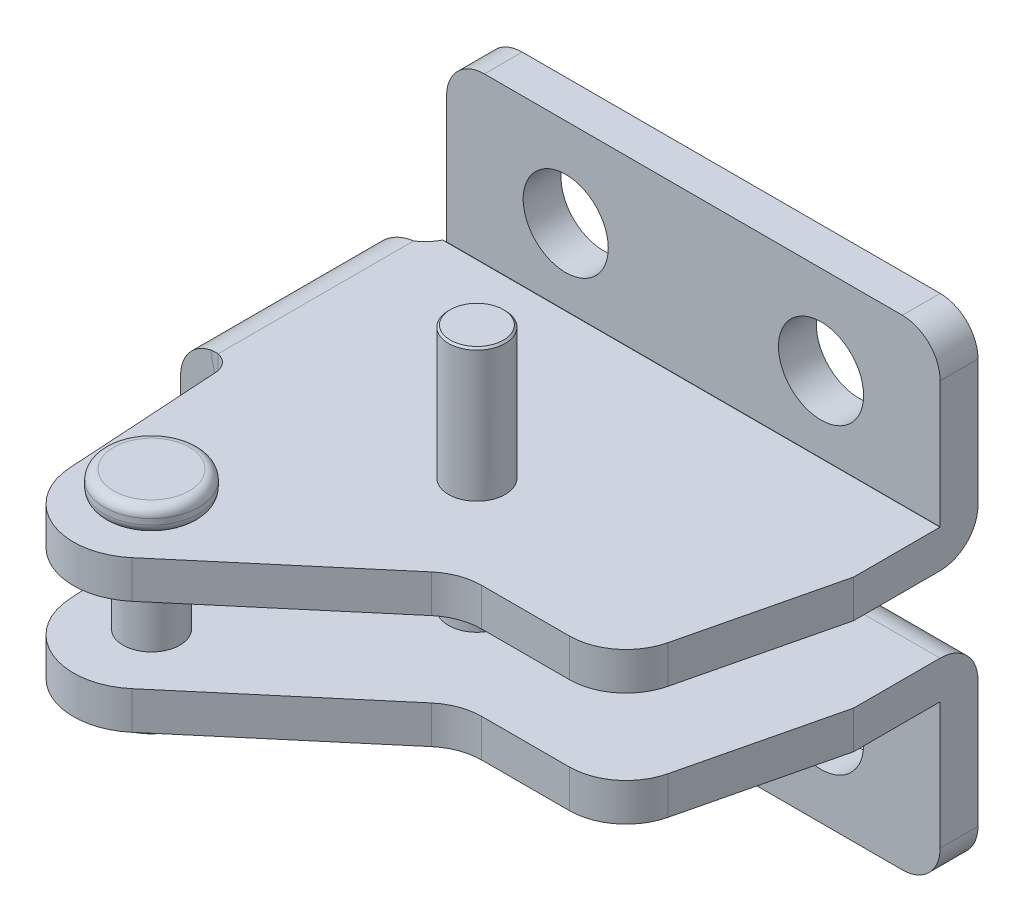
ISO-10303-21;
HEADER;
FILE_DESCRIPTION(('STEP AP214'),'2;1');
FILE_NAME('part.step','',(''),(''),'','','');
FILE_SCHEMA(('AUTOMOTIVE_DESIGN { 1 0 10303 214 1 1 1 1 }'));
ENDSEC;
DATA;
#1=APPLICATION_CONTEXT('core data for automotive mechanical design processes');
#2=APPLICATION_PROTOCOL_DEFINITION('international standard','automotive_design',2000,#1);
#3=PRODUCT_CONTEXT('',#1,'mechanical');
#4=PRODUCT('Part','Part','',(#3));
#5=PRODUCT_RELATED_PRODUCT_CATEGORY('part','',(#4));
#6=PRODUCT_DEFINITION_FORMATION('','',#4);
#7=PRODUCT_DEFINITION_CONTEXT('part definition',#1,'design');
#8=PRODUCT_DEFINITION('design','',#6,#7);
#9=PRODUCT_DEFINITION_SHAPE('','',#8);
#10=(LENGTH_UNIT() NAMED_UNIT(*) SI_UNIT(.MILLI.,.METRE.));
#11=(NAMED_UNIT(*) PLANE_ANGLE_UNIT() SI_UNIT($,.RADIAN.));
#12=(NAMED_UNIT(*) SI_UNIT($,.STERADIAN.) SOLID_ANGLE_UNIT());
#13=UNCERTAINTY_MEASURE_WITH_UNIT(LENGTH_MEASURE(1.E-05),#10,'distance_accuracy_value','');
#14=(GEOMETRIC_REPRESENTATION_CONTEXT(3) GLOBAL_UNCERTAINTY_ASSIGNED_CONTEXT((#13)) GLOBAL_UNIT_ASSIGNED_CONTEXT((#10,
#11,#12)) REPRESENTATION_CONTEXT('',''));
#15=CARTESIAN_POINT('',(0.,0.,0.));
#16=DIRECTION('',(0.,0.,1.));
#17=DIRECTION('',(1.,0.,0.));
#18=AXIS2_PLACEMENT_3D('',#15,#16,#17);
#19=CARTESIAN_POINT('',(5.31017813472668,19.0174570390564,12.0069472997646));
#20=DIRECTION('',(0.,-1.,0.));
#21=DIRECTION('',(0.236097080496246,0.,-0.971729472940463));
#22=AXIS2_PLACEMENT_3D('',#19,#20,#21);
#23=CYLINDRICAL_SURFACE('',#22,1.5);
#24=CARTESIAN_POINT('',(5.31017813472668,6.00000000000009,12.0069472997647));
#25=DIRECTION('',(0.,1.,0.));
#26=DIRECTION('',(-1.,0.,0.));
#27=AXIS2_PLACEMENT_3D('',#24,#25,#26);
#28=CIRCLE('',#27,1.5);
#29=CARTESIAN_POINT('',(3.81017813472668,6.00000000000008,12.0069472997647));
#30=VERTEX_POINT('',#29);
#31=EDGE_CURVE('E849',#30,#30,#28,.F.);
#32=ORIENTED_EDGE('',*,*,#31,.F.);
#33=EDGE_LOOP('',(#32));
#34=FACE_BOUND('',#33,.T.);
#35=CARTESIAN_POINT('',(5.31017813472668,10.,12.0069472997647));
#36=DIRECTION('',(0.,-1.,0.));
#37=DIRECTION('',(1.,0.,0.));
#38=AXIS2_PLACEMENT_3D('',#35,#36,#37);
#39=CIRCLE('',#38,1.5);
#40=CARTESIAN_POINT('',(6.81017813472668,10.,12.0069472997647));
#41=VERTEX_POINT('',#40);
#42=EDGE_CURVE('E845',#41,#41,#39,.F.);
#43=ORIENTED_EDGE('',*,*,#42,.F.);
#44=EDGE_LOOP('',(#43));
#45=FACE_BOUND('',#44,.T.);
#46=ADVANCED_FACE('F14',(#34,#45),#23,.T.);
#47=CARTESIAN_POINT('',(-2.38976150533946,2.71745703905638,21.5126528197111));
#48=DIRECTION('',(0.,1.,0.));
#49=DIRECTION('',(-0.933181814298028,0.,-0.359404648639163));
#50=AXIS2_PLACEMENT_3D('',#47,#48,#49);
#51=PLANE('',#50);
#52=CARTESIAN_POINT('',(-2.38976150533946,2.71745703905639,21.5126528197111));
#53=DIRECTION('',(0.,1.,0.));
#54=DIRECTION('',(-0.933181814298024,0.,-0.359404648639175));
#55=AXIS2_PLACEMENT_3D('',#52,#53,#54);
#56=CIRCLE('',#55,2.);
#57=CARTESIAN_POINT('',(-4.25612513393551,2.71745703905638,20.7938435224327));
#58=VERTEX_POINT('',#57);
#59=CARTESIAN_POINT('',(-0.5233978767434,2.71745703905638,22.2314621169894));
#60=VERTEX_POINT('',#59);
#61=EDGE_CURVE('E971',#58,#60,#56,.T.);
#62=ORIENTED_EDGE('',*,*,#61,.F.);
#63=CARTESIAN_POINT('',(-2.38976150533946,2.71745703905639,21.5126528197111));
#64=DIRECTION('',(0.,1.,0.));
#65=DIRECTION('',(0.933181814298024,0.,0.359404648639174));
#66=AXIS2_PLACEMENT_3D('',#63,#64,#65);
#67=CIRCLE('',#66,2.);
#68=EDGE_CURVE('E982',#60,#58,#67,.T.);
#69=ORIENTED_EDGE('',*,*,#68,.F.);
#70=EDGE_LOOP('',(#62,#69));
#71=FACE_BOUND('',#70,.T.);
#72=ADVANCED_FACE('F813',(#71),#51,.F.);
#73=CARTESIAN_POINT('',(-2.38976150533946,3.21745703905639,21.5126528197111));
#74=DIRECTION('',(0.,1.,0.));
#75=DIRECTION('',(-0.933181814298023,0.,-0.359404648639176));
#76=AXIS2_PLACEMENT_3D('',#73,#74,#75);
#77=TOROIDAL_SURFACE('',#76,2.,0.5);
#78=ORIENTED_EDGE('',*,*,#61,.T.);
#79=ORIENTED_EDGE('',*,*,#68,.T.);
#80=EDGE_LOOP('',(#78,#79));
#81=FACE_BOUND('',#80,.T.);
#82=CARTESIAN_POINT('',(-2.38976150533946,3.21745703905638,21.5126528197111));
#83=DIRECTION('',(0.,-1.,0.));
#84=DIRECTION('',(0.933181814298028,0.,0.359404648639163));
#85=AXIS2_PLACEMENT_3D('',#82,#83,#84);
#86=CIRCLE('',#85,2.5);
#87=CARTESIAN_POINT('',(-0.05680696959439,3.21745703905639,22.411164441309));
#88=VERTEX_POINT('',#87);
#89=EDGE_CURVE('E928',#88,#88,#86,.F.);
#90=ORIENTED_EDGE('',*,*,#89,.F.);
#91=EDGE_LOOP('',(#90));
#92=FACE_BOUND('',#91,.T.);
#93=ADVANCED_FACE('F820',(#81,#92),#77,.T.);
#94=CARTESIAN_POINT('',(-1.38899308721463E-11,0.,2.));
#95=DIRECTION('',(-6.94400379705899E-12,0.,1.));
#96=DIRECTION('',(1.,0.,6.94400379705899E-12));
#97=AXIS2_PLACEMENT_3D('',#94,#95,#96);
#98=CYLINDRICAL_SURFACE('',#97,2.25);
#99=CARTESIAN_POINT('',(0.,0.,0.));
#100=DIRECTION('',(-6.94400379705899E-12,0.,1.));
#101=DIRECTION('',(1.,0.,6.94400379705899E-12));
#102=AXIS2_PLACEMENT_3D('',#99,#100,#101);
#103=CIRCLE('',#102,2.25);
#104=CARTESIAN_POINT('',(2.25,0.,1.56235748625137E-11));
#105=VERTEX_POINT('',#104);
#106=EDGE_CURVE('E471',#105,#105,#103,.T.);
#107=ORIENTED_EDGE('',*,*,#106,.F.);
#108=EDGE_LOOP('',(#107));
#109=FACE_BOUND('',#108,.T.);
#110=CARTESIAN_POINT('',(-1.38899308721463E-11,0.,2.));
#111=DIRECTION('',(-6.94400379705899E-12,0.,1.));
#112=DIRECTION('',(1.,0.,6.94400379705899E-12));
#113=AXIS2_PLACEMENT_3D('',#110,#111,#112);
#114=CIRCLE('',#113,2.25);
#115=CARTESIAN_POINT('',(2.24999999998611,0.,2.00000000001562));
#116=VERTEX_POINT('',#115);
#117=EDGE_CURVE('E550',#116,#116,#114,.F.);
#118=ORIENTED_EDGE('',*,*,#117,.F.);
#119=EDGE_LOOP('',(#118));
#120=FACE_BOUND('',#119,.T.);
#121=ADVANCED_FACE('F1660',(#109,#120),#98,.F.);
#122=CARTESIAN_POINT('',(13.4999999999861,1.04083408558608E-13,2.00000000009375));
#123=DIRECTION('',(-6.94400379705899E-12,0.,1.));
#124=DIRECTION('',(1.,0.,6.94400379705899E-12));
#125=AXIS2_PLACEMENT_3D('',#122,#123,#124);
#126=CYLINDRICAL_SURFACE('',#125,2.25);
#127=CARTESIAN_POINT('',(13.5,1.00613961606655E-13,9.3754648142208E-11));
#128=DIRECTION('',(-6.94400379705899E-12,0.,1.));
#129=DIRECTION('',(1.,0.,6.94400379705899E-12));
#130=AXIS2_PLACEMENT_3D('',#127,#128,#129);
#131=CIRCLE('',#130,2.25);
#132=CARTESIAN_POINT('',(15.75,1.16146761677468E-13,1.09378656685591E-10));
#133=VERTEX_POINT('',#132);
#134=EDGE_CURVE('E467',#133,#133,#131,.T.);
#135=ORIENTED_EDGE('',*,*,#134,.F.);
#136=EDGE_LOOP('',(#135));
#137=FACE_BOUND('',#136,.T.);
#138=CARTESIAN_POINT('',(13.4999999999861,1.04083408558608E-13,2.00000000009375));
#139=DIRECTION('',(-6.94400379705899E-12,0.,1.));
#140=DIRECTION('',(1.,0.,6.94400379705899E-12));
#141=AXIS2_PLACEMENT_3D('',#138,#139,#140);
#142=CIRCLE('',#141,2.25);
#143=CARTESIAN_POINT('',(15.7499999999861,1.19616208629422E-13,2.00000000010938));
#144=VERTEX_POINT('',#143);
#145=EDGE_CURVE('E547',#144,#144,#142,.F.);
#146=ORIENTED_EDGE('',*,*,#145,.F.);
#147=EDGE_LOOP('',(#146));
#148=FACE_BOUND('',#147,.T.);
#149=ADVANCED_FACE('F1668',(#137,#148),#126,.F.);
#150=CARTESIAN_POINT('',(17.8,-4.6999999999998,1.23631790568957E-10));
#151=DIRECTION('',(0.,1.,0.));
#152=DIRECTION('',(-1.,0.,-6.95098676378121E-12));
#153=AXIS2_PLACEMENT_3D('',#150,#151,#152);
#154=PLANE('',#153);
#155=DIRECTION('',(-6.94400380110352E-12,0.,1.));
#156=VECTOR('',#155,1.);
#157=CARTESIAN_POINT('',(-4.3,-4.6999999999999,-2.98331238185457E-11));
#158=LINE('',#157,#156);
#159=CARTESIAN_POINT('',(-4.3,-4.6999999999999,-2.98331238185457E-11));
#160=VERTEX_POINT('',#159);
#161=CARTESIAN_POINT('',(-4.30000000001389,-4.6999999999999,1.99999999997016));
#162=VERTEX_POINT('',#161);
#163=EDGE_CURVE('E537',#160,#162,#158,.T.);
#164=ORIENTED_EDGE('',*,*,#163,.F.);
#165=DIRECTION('',(-1.,0.,-6.94400380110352E-12));
#166=VECTOR('',#165,1.);
#167=CARTESIAN_POINT('',(14.9808750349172,-4.69999999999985,1.04051749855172E-10));
#168=LINE('',#167,#166);
#169=CARTESIAN_POINT('',(17.8,-4.6999999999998,1.23631790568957E-10));
#170=VERTEX_POINT('',#169);
#171=EDGE_CURVE('E462',#170,#160,#168,.T.);
#172=ORIENTED_EDGE('',*,*,#171,.F.);
#173=DIRECTION('',(-6.95098676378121E-12,0.,1.));
#174=VECTOR('',#173,1.);
#175=CARTESIAN_POINT('',(17.8,-4.6999999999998,1.23631790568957E-10));
#176=LINE('',#175,#174);
#177=CARTESIAN_POINT('',(17.7999999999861,-4.6999999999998,2.00000000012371));
#178=VERTEX_POINT('',#177);
#179=EDGE_CURVE('E545',#178,#170,#176,.F.);
#180=ORIENTED_EDGE('',*,*,#179,.F.);
#181=DIRECTION('',(-1.,0.,-6.95098676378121E-12));
#182=VECTOR('',#181,1.);
#183=CARTESIAN_POINT('',(17.7999999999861,-4.6999999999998,2.00000000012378));
#184=LINE('',#183,#182);
#185=EDGE_CURVE('E542',#162,#178,#184,.F.);
#186=ORIENTED_EDGE('',*,*,#185,.F.);
#187=EDGE_LOOP('',(#164,#172,#180,#186));
#188=FACE_BOUND('',#187,.T.);
#189=ADVANCED_FACE('F1678',(#188),#154,.F.);
#190=CARTESIAN_POINT('',(-4.3,-2.6999999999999,-2.9841146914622E-11));
#191=DIRECTION('',(-6.94400380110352E-12,0.,1.));
#192=DIRECTION('',(1.,0.,6.94400380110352E-12));
#193=AXIS2_PLACEMENT_3D('',#190,#191,#192);
#194=CYLINDRICAL_SURFACE('',#193,2.);
#195=CARTESIAN_POINT('',(-4.3,-2.6999999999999,-2.9841146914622E-11));
#196=DIRECTION('',(-6.94400380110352E-12,0.,1.));
#197=DIRECTION('',(1.,0.,6.94400380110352E-12));
#198=AXIS2_PLACEMENT_3D('',#195,#196,#197);
#199=CIRCLE('',#198,2.);
#200=CARTESIAN_POINT('',(-6.3,-2.6999999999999,-4.37263072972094E-11));
#201=VERTEX_POINT('',#200);
#202=EDGE_CURVE('E459',#160,#201,#199,.F.);
#203=ORIENTED_EDGE('',*,*,#202,.F.);
#204=ORIENTED_EDGE('',*,*,#163,.T.);
#205=CARTESIAN_POINT('',(-4.3000000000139,-2.69999999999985,1.99999999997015));
#206=DIRECTION('',(-6.94400380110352E-12,0.,1.));
#207=DIRECTION('',(1.,0.,6.94400380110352E-12));
#208=AXIS2_PLACEMENT_3D('',#205,#206,#207);
#209=CIRCLE('',#208,2.);
#210=CARTESIAN_POINT('',(-6.3000000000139,-2.6999999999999,1.99999999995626));
#211=VERTEX_POINT('',#210);
#212=EDGE_CURVE('E538',#162,#211,#209,.F.);
#213=ORIENTED_EDGE('',*,*,#212,.T.);
#214=DIRECTION('',(-6.94400380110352E-12,0.,1.));
#215=VECTOR('',#214,1.);
#216=CARTESIAN_POINT('',(-6.3,-2.6999999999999,-4.37263072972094E-11));
#217=LINE('',#216,#215);
#218=EDGE_CURVE('E541',#211,#201,#217,.F.);
#219=ORIENTED_EDGE('',*,*,#218,.T.);
#220=EDGE_LOOP('',(#203,#204,#213,#219));
#221=FACE_BOUND('',#220,.T.);
#222=ADVANCED_FACE('F807',(#221),#194,.T.);
#223=CARTESIAN_POINT('',(-2.38976150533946,4.01745703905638,21.5126528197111));
#224=DIRECTION('',(0.,-1.,0.));
#225=DIRECTION('',(0.933181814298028,0.,0.359404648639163));
#226=AXIS2_PLACEMENT_3D('',#223,#224,#225);
#227=CYLINDRICAL_SURFACE('',#226,2.5);
#228=CARTESIAN_POINT('',(-2.38976150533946,3.51745703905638,21.5126528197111));
#229=DIRECTION('',(0.,1.,0.));
#230=DIRECTION('',(-0.933181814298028,0.,-0.359404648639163));
#231=AXIS2_PLACEMENT_3D('',#228,#229,#230);
#232=CIRCLE('',#231,2.5);
#233=CARTESIAN_POINT('',(-4.72271604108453,3.51745703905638,20.6141411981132));
#234=VERTEX_POINT('',#233);
#235=EDGE_CURVE('E925',#234,#234,#232,.T.);
#236=ORIENTED_EDGE('',*,*,#235,.F.);
#237=EDGE_LOOP('',(#236));
#238=FACE_BOUND('',#237,.T.);
#239=ORIENTED_EDGE('',*,*,#89,.T.);
#240=EDGE_LOOP('',(#239));
#241=FACE_BOUND('',#240,.T.);
#242=ADVANCED_FACE('F801',(#238,#241),#227,.T.);
#243=CARTESIAN_POINT('',(-1.40096267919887E-11,16.,1.99999999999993));
#244=DIRECTION('',(-6.94400379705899E-12,0.,1.));
#245=DIRECTION('',(1.,0.,6.94400379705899E-12));
#246=AXIS2_PLACEMENT_3D('',#243,#244,#245);
#247=CYLINDRICAL_SURFACE('',#246,2.25);
#248=CARTESIAN_POINT('',(-1.196959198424E-13,16.,0.));
#249=DIRECTION('',(-6.94400379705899E-12,0.,1.));
#250=DIRECTION('',(1.,0.,6.94400379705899E-12));
#251=AXIS2_PLACEMENT_3D('',#248,#249,#250);
#252=CIRCLE('',#251,2.25);
#253=CARTESIAN_POINT('',(2.24999999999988,16.,1.5714864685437E-11));
#254=VERTEX_POINT('',#253);
#255=EDGE_CURVE('E1216',#254,#254,#252,.T.);
#256=ORIENTED_EDGE('',*,*,#255,.F.);
#257=EDGE_LOOP('',(#256));
#258=FACE_BOUND('',#257,.T.);
#259=CARTESIAN_POINT('',(-1.40096267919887E-11,16.,1.99999999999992));
#260=DIRECTION('',(-6.94400379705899E-12,0.,1.));
#261=DIRECTION('',(1.,0.,6.94400379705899E-12));
#262=AXIS2_PLACEMENT_3D('',#259,#260,#261);
#263=CIRCLE('',#262,2.25);
#264=CARTESIAN_POINT('',(2.24999999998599,16.,2.00000000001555));
#265=VERTEX_POINT('',#264);
#266=EDGE_CURVE('E21',#265,#265,#263,.F.);
#267=ORIENTED_EDGE('',*,*,#266,.F.);
#268=EDGE_LOOP('',(#267));
#269=FACE_BOUND('',#268,.T.);
#270=ADVANCED_FACE('F798',(#258,#269),#247,.F.);
#271=CARTESIAN_POINT('',(13.499999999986,16.,2.00000000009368));
#272=DIRECTION('',(-6.94400379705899E-12,0.,1.));
#273=DIRECTION('',(1.,0.,6.94400379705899E-12));
#274=AXIS2_PLACEMENT_3D('',#271,#272,#273);
#275=CYLINDRICAL_SURFACE('',#274,2.25);
#276=CARTESIAN_POINT('',(13.5,16.,9.37756816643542E-11));
#277=DIRECTION('',(-6.94400379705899E-12,0.,1.));
#278=DIRECTION('',(1.,0.,6.94400379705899E-12));
#279=AXIS2_PLACEMENT_3D('',#276,#277,#278);
#280=CIRCLE('',#279,2.25);
#281=CARTESIAN_POINT('',(15.75,16.,1.09399690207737E-10));
#282=VERTEX_POINT('',#281);
#283=EDGE_CURVE('E761',#282,#282,#280,.T.);
#284=ORIENTED_EDGE('',*,*,#283,.F.);
#285=EDGE_LOOP('',(#284));
#286=FACE_BOUND('',#285,.T.);
#287=CARTESIAN_POINT('',(13.499999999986,16.,2.00000000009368));
#288=DIRECTION('',(-6.94400379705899E-12,0.,1.));
#289=DIRECTION('',(1.,0.,6.94400379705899E-12));
#290=AXIS2_PLACEMENT_3D('',#287,#288,#289);
#291=CIRCLE('',#290,2.25);
#292=CARTESIAN_POINT('',(15.749999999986,16.,2.0000000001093));
#293=VERTEX_POINT('',#292);
#294=EDGE_CURVE('E361',#293,#293,#291,.F.);
#295=ORIENTED_EDGE('',*,*,#294,.F.);
#296=EDGE_LOOP('',(#295));
#297=FACE_BOUND('',#296,.T.);
#298=ADVANCED_FACE('F794',(#286,#297),#275,.F.);
#299=CARTESIAN_POINT('',(-4.30000000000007,20.7,-2.97411834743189E-11));
#300=DIRECTION('',(0.,-1.,0.));
#301=DIRECTION('',(1.,0.,6.95098676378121E-12));
#302=AXIS2_PLACEMENT_3D('',#299,#300,#301);
#303=PLANE('',#302);
#304=DIRECTION('',(-6.93971474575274E-12,0.,1.));
#305=VECTOR('',#304,1.);
#306=CARTESIAN_POINT('',(17.8,20.7,1.23628754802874E-10));
#307=LINE('',#306,#305);
#308=CARTESIAN_POINT('',(17.8,20.7,1.23628754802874E-10));
#309=VERTEX_POINT('',#308);
#310=CARTESIAN_POINT('',(17.799999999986,20.7,2.00000000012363));
#311=VERTEX_POINT('',#310);
#312=EDGE_CURVE('E354',#309,#311,#307,.T.);
#313=ORIENTED_EDGE('',*,*,#312,.F.);
#314=DIRECTION('',(-1.,0.,-6.93971474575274E-12));
#315=VECTOR('',#314,1.);
#316=CARTESIAN_POINT('',(-36.5791738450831,20.7,-2.53741255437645E-10));
#317=LINE('',#316,#315);
#318=CARTESIAN_POINT('',(-4.30000000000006,20.7,-2.97411834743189E-11));
#319=VERTEX_POINT('',#318);
#320=EDGE_CURVE('E349',#319,#309,#317,.F.);
#321=ORIENTED_EDGE('',*,*,#320,.F.);
#322=DIRECTION('',(-6.95098676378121E-12,0.,1.));
#323=VECTOR('',#322,1.);
#324=CARTESIAN_POINT('',(-4.30000000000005,20.7,-2.97411834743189E-11));
#325=LINE('',#324,#323);
#326=CARTESIAN_POINT('',(-4.30000000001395,20.7,1.99999999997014));
#327=VERTEX_POINT('',#326);
#328=EDGE_CURVE('E333',#327,#319,#325,.F.);
#329=ORIENTED_EDGE('',*,*,#328,.F.);
#330=DIRECTION('',(1.,0.,6.95098676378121E-12));
#331=VECTOR('',#330,1.);
#332=CARTESIAN_POINT('',(-4.30000000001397,20.7,1.99999999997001));
#333=LINE('',#332,#331);
#334=EDGE_CURVE('E339',#311,#327,#333,.F.);
#335=ORIENTED_EDGE('',*,*,#334,.F.);
#336=EDGE_LOOP('',(#313,#321,#329,#335));
#337=FACE_BOUND('',#336,.T.);
#338=ADVANCED_FACE('F347',(#337),#303,.F.);
#339=CARTESIAN_POINT('',(-4.30000000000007,18.7,-2.97431350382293E-11));
#340=DIRECTION('',(-6.93971474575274E-12,0.,1.));
#341=DIRECTION('',(1.,0.,6.93971474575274E-12));
#342=AXIS2_PLACEMENT_3D('',#339,#340,#341);
#343=CYLINDRICAL_SURFACE('',#342,2.);
#344=CARTESIAN_POINT('',(-4.30000000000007,18.7,-2.97481223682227E-11));
#345=DIRECTION('',(-6.93971474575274E-12,0.,1.));
#346=DIRECTION('',(1.,0.,6.93971474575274E-12));
#347=AXIS2_PLACEMENT_3D('',#344,#345,#346);
#348=CIRCLE('',#347,2.);
#349=CARTESIAN_POINT('',(-6.30000000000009,18.7,-4.36230912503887E-11));
#350=VERTEX_POINT('',#349);
#351=EDGE_CURVE('E755',#350,#319,#348,.F.);
#352=ORIENTED_EDGE('',*,*,#351,.F.);
#353=DIRECTION('',(-6.93971474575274E-12,0.,1.));
#354=VECTOR('',#353,1.);
#355=CARTESIAN_POINT('',(-6.30000000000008,18.7,-4.36181039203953E-11));
#356=LINE('',#355,#354);
#357=CARTESIAN_POINT('',(-6.30000000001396,18.7,1.99999999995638));
#358=VERTEX_POINT('',#357);
#359=EDGE_CURVE('E335',#350,#358,#356,.T.);
#360=ORIENTED_EDGE('',*,*,#359,.T.);
#361=CARTESIAN_POINT('',(-4.30000000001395,18.7,1.99999999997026));
#362=DIRECTION('',(-6.93971474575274E-12,0.,1.));
#363=DIRECTION('',(1.,0.,6.93971474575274E-12));
#364=AXIS2_PLACEMENT_3D('',#361,#362,#363);
#365=CIRCLE('',#364,2.);
#366=EDGE_CURVE('E326',#358,#327,#365,.F.);
#367=ORIENTED_EDGE('',*,*,#366,.T.);
#368=ORIENTED_EDGE('',*,*,#328,.T.);
#369=EDGE_LOOP('',(#352,#360,#367,#368));
#370=FACE_BOUND('',#369,.T.);
#371=ADVANCED_FACE('F331',(#370),#343,.T.);
#372=CARTESIAN_POINT('',(-9.23264511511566,-17.78002444,13.7899999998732));
#373=DIRECTION('',(1.,0.,6.93971474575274E-12));
#374=DIRECTION('',(6.93971474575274E-12,0.,-1.));
#375=AXIS2_PLACEMENT_3D('',#372,#373,#374);
#376=PLANE('',#375);
#377=DIRECTION('',(6.93971474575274E-12,0.,-1.));
#378=VECTOR('',#377,1.);
#379=CARTESIAN_POINT('',(-9.23264511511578,9.99,13.7899999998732));
#380=LINE('',#379,#378);
#381=CARTESIAN_POINT('',(-9.23264511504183,9.99,3.13349570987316));
#382=VERTEX_POINT('',#381);
#383=CARTESIAN_POINT('',(-9.23264511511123,9.99,13.1334957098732));
#384=VERTEX_POINT('',#383);
#385=EDGE_CURVE('E558',#382,#384,#380,.F.);
#386=ORIENTED_EDGE('',*,*,#385,.F.);
#387=DIRECTION('',(0.,1.,0.));
#388=VECTOR('',#387,1.);
#389=CARTESIAN_POINT('',(-9.23264511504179,5.5008505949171,3.13349570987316));
#390=LINE('',#389,#388);
#391=CARTESIAN_POINT('',(-9.2326451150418,6.01,3.13349570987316));
#392=VERTEX_POINT('',#391);
#393=EDGE_CURVE('E520',#382,#392,#390,.F.);
#394=ORIENTED_EDGE('',*,*,#393,.T.);
#395=DIRECTION('',(6.93971474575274E-12,0.,-1.));
#396=VECTOR('',#395,1.);
#397=CARTESIAN_POINT('',(-9.2326451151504,6.01,18.7815591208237));
#398=LINE('',#397,#396);
#399=CARTESIAN_POINT('',(-9.23264511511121,6.01,13.1334957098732));
#400=VERTEX_POINT('',#399);
#401=EDGE_CURVE('E1116',#400,#392,#398,.T.);
#402=ORIENTED_EDGE('',*,*,#401,.F.);
#403=DIRECTION('',(0.,1.,0.));
#404=VECTOR('',#403,1.);
#405=CARTESIAN_POINT('',(-9.2326451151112,4.63462200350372,13.1334957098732));
#406=LINE('',#405,#404);
#407=EDGE_CURVE('E523',#400,#384,#406,.T.);
#408=ORIENTED_EDGE('',*,*,#407,.T.);
#409=EDGE_LOOP('',(#386,#394,#402,#408));
#410=FACE_BOUND('',#409,.T.);
#411=ADVANCED_FACE('F501',(#410),#376,.F.);
#412=CARTESIAN_POINT('',(-7.6439044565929,4.02419019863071,13.1334957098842));
#413=CARTESIAN_POINT('',(-7.52015784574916,3.99793923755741,13.1365842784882));
#414=CARTESIAN_POINT('',(-7.42179202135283,3.98855438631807,13.140003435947));
#415=CARTESIAN_POINT('',(-7.28062833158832,3.97959614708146,13.1475171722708));
#416=CARTESIAN_POINT('',(-7.23766449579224,3.98,13.151616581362));
#417=CARTESIAN_POINT('',(-7.22264511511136,3.98,13.1560369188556));
#418=CARTESIAN_POINT('',(-7.63975411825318,4.04375482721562,13.1334957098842));
#419=CARTESIAN_POINT('',(-7.51722669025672,4.01776249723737,13.1365842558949));
#420=CARTESIAN_POINT('',(-7.41982998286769,4.00847010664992,13.140003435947));
#421=CARTESIAN_POINT('',(-7.2800570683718,3.99960012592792,13.1475171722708));
#422=CARTESIAN_POINT('',(-7.23751652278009,4.,13.1516165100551));
#423=CARTESIAN_POINT('',(-7.22264511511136,4.,13.1560369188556));
#424=CARTESIAN_POINT('',(-7.22472028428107,6.00021768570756,13.1334957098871));
#425=CARTESIAN_POINT('',(-7.22411114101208,6.00008846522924,13.1365819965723));
#426=CARTESIAN_POINT('',(-7.22362613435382,6.0000421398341,13.1400034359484));
#427=CARTESIAN_POINT('',(-7.22293074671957,5.99999801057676,13.1475171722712));
#428=CARTESIAN_POINT('',(-7.22271922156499,6.,13.1516093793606));
#429=CARTESIAN_POINT('',(-7.22264511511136,6.,13.1560369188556));
#430=CARTESIAN_POINT('',(-7.22052844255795,6.01997796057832,13.1334957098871));
#431=CARTESIAN_POINT('',(-7.22115067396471,6.02010995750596,13.1365819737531));
#432=CARTESIAN_POINT('',(-7.22164447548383,6.02015701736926,13.1400034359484));
#433=CARTESIAN_POINT('',(-7.22235377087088,6.02020202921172,13.1475171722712));
#434=CARTESIAN_POINT('',(-7.22256976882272,6.0202,13.1516093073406));
#435=CARTESIAN_POINT('',(-7.22264511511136,6.0202,13.1560369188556));
#436=B_SPLINE_SURFACE_WITH_KNOTS('',1,3,((#412,#413,#414,#415,#416,#417),(#418,#419,#420,#421,
#422,#423),(#424,#425,#426,#427,#428,#429),(#430,#431,#432,#433,#434,#435)),.UNSPECIFIED.,.F.,
.F.,.F.,(2,1,1,2),(4,2,4),(-0.01,0.,1.,1.0101),(0.,0.5,1.),.UNSPECIFIED.);
#437=CARTESIAN_POINT('',(-7.22264511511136,4.,13.1560369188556));
#438=CARTESIAN_POINT('',(-7.22417852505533,3.9999999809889,13.1555924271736));
#439=CARTESIAN_POINT('',(-7.22572648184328,4.00000175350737,13.1552072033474));
#440=CARTESIAN_POINT('',(-7.2288389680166,4.00000894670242,13.1545171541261));
#441=CARTESIAN_POINT('',(-7.23040347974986,4.00001436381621,13.1542122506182));
#442=CARTESIAN_POINT('',(-7.23510395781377,4.00003616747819,13.1533605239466));
#443=CARTESIAN_POINT('',(-7.23825052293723,4.0000581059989,13.1528758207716));
#444=CARTESIAN_POINT('',(-7.24769866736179,4.00014628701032,13.151547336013));
#445=CARTESIAN_POINT('',(-7.25401675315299,4.00023489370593,13.1508276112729));
#446=CARTESIAN_POINT('',(-7.26665836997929,4.00047199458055,13.1495317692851));
#447=CARTESIAN_POINT('',(-7.27298188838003,4.00062042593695,13.1489555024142));
#448=CARTESIAN_POINT('',(-7.28563763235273,4.00097734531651,13.1478931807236));
#449=CARTESIAN_POINT('',(-7.29196986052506,4.00118585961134,13.1474071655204));
#450=CARTESIAN_POINT('',(-7.3107897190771,4.00189475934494,13.1460510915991));
#451=CARTESIAN_POINT('',(-7.32328024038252,4.00248188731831,13.1452667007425));
#452=CARTESIAN_POINT('',(-7.34825328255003,4.00388958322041,13.1438305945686));
#453=CARTESIAN_POINT('',(-7.36073580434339,4.00471011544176,13.1431788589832));
#454=CARTESIAN_POINT('',(-7.39819134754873,4.00752379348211,13.1413542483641));
#455=CARTESIAN_POINT('',(-7.42314514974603,4.00986799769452,13.1403136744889));
#456=CARTESIAN_POINT('',(-7.48024402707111,4.01631189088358,13.1381455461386));
#457=CARTESIAN_POINT('',(-7.51235633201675,4.02072456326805,13.1370816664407));
#458=CARTESIAN_POINT('',(-7.57628436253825,4.0310894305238,13.1351615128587));
#459=CARTESIAN_POINT('',(-7.60810048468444,4.03703911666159,13.1343049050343));
#460=CARTESIAN_POINT('',(-7.63975411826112,4.04375482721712,13.133495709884));
#461=B_SPLINE_CURVE_WITH_KNOTS('',3,(#437,#438,#439,#440,#441,#442,#443,#444,#445,#446,#447,
#448,#449,#450,#451,#452,#453,#454,#455,#456,#457,#458,#459,#460),.UNSPECIFIED.,.F.,.F.,(4,2,2,
2,2,2,2,2,2,2,2,4),(0.,0.00478486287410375,0.00956505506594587,0.0191141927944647,
0.0381878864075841,0.0572416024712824,0.0763036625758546,0.113886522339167,0.151463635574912,
0.226699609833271,0.323954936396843,0.421052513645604),.UNSPECIFIED.);
#462=CARTESIAN_POINT('',(-7.22264511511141,4.,13.1560369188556));
#463=VERTEX_POINT('',#462);
#464=CARTESIAN_POINT('',(-7.63975411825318,4.04375482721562,13.1334957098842));
#465=VERTEX_POINT('',#464);
#466=EDGE_CURVE('E481',#463,#465,#461,.T.);
#467=DIRECTION('',(0.,-1.,0.));
#468=VECTOR('',#467,1.);
#469=CARTESIAN_POINT('',(-7.22264511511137,6.,13.1560369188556));
#470=LINE('',#469,#468);
#471=CARTESIAN_POINT('',(-7.22264511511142,6.,13.1560369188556));
#472=VERTEX_POINT('',#471);
#473=EDGE_CURVE('E1110',#463,#472,#470,.F.);
#474=CARTESIAN_POINT('',(-7.22472028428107,6.00021768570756,13.1334957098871));
#475=CARTESIAN_POINT('',(-7.22408293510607,6.00010028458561,13.1367781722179));
#476=CARTESIAN_POINT('',(-7.22362997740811,6.00004663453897,13.1400876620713));
#477=CARTESIAN_POINT('',(-7.22311024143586,6.00000680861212,13.1455069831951));
#478=CARTESIAN_POINT('',(-7.22296262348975,6.00000303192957,13.1476085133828));
#479=CARTESIAN_POINT('',(-7.22274884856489,6.00000140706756,13.1518193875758));
#480=CARTESIAN_POINT('',(-7.22268282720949,6.0000035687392,13.1539287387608));
#481=CARTESIAN_POINT('',(-7.22264511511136,6.,13.1560369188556));
#482=B_SPLINE_CURVE_WITH_KNOTS('',3,(#474,#475,#476,#477,#478,#479,#480,#481),.UNSPECIFIED.,.F.,
.F.,(4,2,2,4),(0.,0.010016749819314,0.0163344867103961,0.0226627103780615),.UNSPECIFIED.);
#483=CARTESIAN_POINT('',(-7.22472028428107,6.00021768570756,13.1334957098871));
#484=VERTEX_POINT('',#483);
#485=EDGE_CURVE('E513',#484,#472,#482,.T.);
#486=DIRECTION('',(0.207516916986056,0.978231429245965,1.43740188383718E-12));
#487=VECTOR('',#486,1.);
#488=CARTESIAN_POINT('',(-7.43223720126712,5.02198625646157,13.1334957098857));
#489=LINE('',#488,#487);
#490=EDGE_CURVE('E519',#465,#484,#489,.T.);
#491=ORIENTED_EDGE('',*,*,#466,.F.);
#492=ORIENTED_EDGE('',*,*,#473,.T.);
#493=ORIENTED_EDGE('',*,*,#485,.F.);
#494=ORIENTED_EDGE('',*,*,#490,.F.);
#495=EDGE_LOOP('',(#491,#492,#493,#494));
#496=FACE_BOUND('',#495,.T.);
#497=ADVANCED_FACE('F495',(#496),#436,.F.);
#498=CARTESIAN_POINT('',(-7.22264511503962,3.98,2.81851987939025));
#499=CARTESIAN_POINT('',(-7.58375632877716,3.98,2.8710474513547));
#500=CARTESIAN_POINT('',(-7.94395718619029,4.07845789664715,2.92351182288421));
#501=CARTESIAN_POINT('',(-8.56550094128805,4.44542841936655,3.02850376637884));
#502=CARTESIAN_POINT('',(-8.82569791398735,4.71326447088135,3.08096813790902));
#503=CARTESIAN_POINT('',(-9.00012433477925,5.02945544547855,3.13349570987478));
#504=CARTESIAN_POINT('',(-7.22264511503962,4.,2.81851987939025));
#505=CARTESIAN_POINT('',(-7.58019857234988,4.,2.87104713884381));
#506=CARTESIAN_POINT('',(-7.93685066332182,4.09748786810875,2.92351182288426));
#507=CARTESIAN_POINT('',(-8.55227083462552,4.4608429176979,3.02850376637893));
#508=CARTESIAN_POINT('',(-8.80990429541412,4.72604019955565,3.08096845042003));
#509=CARTESIAN_POINT('',(-8.98261222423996,5.03911598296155,3.1334957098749));
#510=CARTESIAN_POINT('',(-7.22264511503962,6.,2.81851987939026));
#511=CARTESIAN_POINT('',(-7.22442292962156,6.,2.8710158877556));
#512=CARTESIAN_POINT('',(-7.22619837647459,6.00048501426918,2.92351182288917));
#513=CARTESIAN_POINT('',(-7.22926016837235,6.0022927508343,3.02850376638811));
#514=CARTESIAN_POINT('',(-7.23054243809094,6.00361306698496,3.08099970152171));
#515=CARTESIAN_POINT('',(-7.23140117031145,6.0051697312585,3.13349570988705));
#516=B_SPLINE_SURFACE_WITH_KNOTS('',1,3,((#498,#499,#500,#501,#502,#503),(#504,#505,#506,#507,
#508,#509),(#510,#511,#512,#513,#514,#515)),.UNSPECIFIED.,.F.,.F.,.F.,(2,1,2),(4,2,4),(-0.01,0.,
1.),(0.,0.5,1.),.UNSPECIFIED.);
#517=CARTESIAN_POINT('',(-8.98261222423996,5.03911598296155,3.1334957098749));
#518=CARTESIAN_POINT('',(-8.954993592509,4.98905108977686,3.12509518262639));
#519=CARTESIAN_POINT('',(-8.92525118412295,4.94018915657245,3.11669829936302));
#520=CARTESIAN_POINT('',(-8.86171672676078,4.84517658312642,3.09990540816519));
#521=CARTESIAN_POINT('',(-8.82792487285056,4.79902581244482,3.09150940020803));
#522=CARTESIAN_POINT('',(-8.72091610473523,4.66527670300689,3.06634676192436));
#523=CARTESIAN_POINT('',(-8.64194955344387,4.58217103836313,3.04957066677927));
#524=CARTESIAN_POINT('',(-8.471075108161,4.43057223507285,3.01601505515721));
#525=CARTESIAN_POINT('',(-8.37916233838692,4.36208462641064,2.9992355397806));
#526=CARTESIAN_POINT('',(-8.18498960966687,4.24165645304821,2.96566495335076));
#527=CARTESIAN_POINT('',(-8.08272492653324,4.18972348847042,2.94887388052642));
#528=CARTESIAN_POINT('',(-7.87080243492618,4.1039350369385,2.91528830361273));
#529=CARTESIAN_POINT('',(-7.7611387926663,4.07009400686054,2.89849380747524));
#530=CARTESIAN_POINT('',(-7.53782324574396,4.0215927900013,2.86492434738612));
#531=CARTESIAN_POINT('',(-7.42418055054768,4.00689097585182,2.84814942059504));
#532=CARTESIAN_POINT('',(-7.28106273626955,4.00063396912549,2.82710247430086));
#533=CARTESIAN_POINT('',(-7.25184767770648,3.99999604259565,2.82281021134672));
#534=CARTESIAN_POINT('',(-7.22264511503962,4.,2.81851987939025));
#535=B_SPLINE_CURVE_WITH_KNOTS('',3,(#517,#518,#519,#520,#521,#522,#523,#524,#525,#526,#527,
#528,#529,#530,#531,#532,#533,#534),.UNSPECIFIED.,.F.,.F.,(4,2,2,2,2,2,2,2,4),(0.,
0.173267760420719,0.346527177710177,0.692326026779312,1.03825545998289,1.38434347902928,
1.73070763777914,2.07631719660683,2.16489332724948),.UNSPECIFIED.);
#536=CARTESIAN_POINT('',(-8.98261222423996,5.03911598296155,3.1334957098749));
#537=VERTEX_POINT('',#536);
#538=CARTESIAN_POINT('',(-7.22264511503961,4.,2.81851987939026));
#539=VERTEX_POINT('',#538);
#540=EDGE_CURVE('E488',#537,#539,#535,.T.);
#541=DIRECTION('',(-0.875605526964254,-0.483026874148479,-6.08034006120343E-12));
#542=VECTOR('',#541,1.);
#543=CARTESIAN_POINT('',(-8.10700669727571,5.52214285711,3.13349570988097));
#544=LINE('',#543,#542);
#545=CARTESIAN_POINT('',(-7.23140117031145,6.0051697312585,3.13349570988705));
#546=VERTEX_POINT('',#545);
#547=EDGE_CURVE('E555',#546,#537,#544,.T.);
#548=CARTESIAN_POINT('',(-7.23140117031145,6.00516973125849,3.13349570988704));
#549=CARTESIAN_POINT('',(-7.23118663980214,6.00478045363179,3.12037171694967));
#550=CARTESIAN_POINT('',(-7.23094586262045,6.00440570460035,3.1072477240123));
#551=CARTESIAN_POINT('',(-7.2304167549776,6.00369142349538,3.08099973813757));
#552=CARTESIAN_POINT('',(-7.23012842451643,6.00335189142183,3.0678757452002));
#553=CARTESIAN_POINT('',(-7.22950915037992,6.00271420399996,3.04162775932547));
#554=CARTESIAN_POINT('',(-7.22917820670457,6.00241604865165,3.02850376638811));
#555=CARTESIAN_POINT('',(-7.22847962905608,6.00186637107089,3.00225578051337));
#556=CARTESIAN_POINT('',(-7.22811199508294,6.00161484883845,2.98913178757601));
#557=CARTESIAN_POINT('',(-7.22734654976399,6.00116291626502,2.96288380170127));
#558=CARTESIAN_POINT('',(-7.22694873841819,6.00096250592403,2.9497598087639));
#559=CARTESIAN_POINT('',(-7.22613000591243,6.00061633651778,2.92351182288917));
#560=CARTESIAN_POINT('',(-7.22570908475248,6.00047057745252,2.91038782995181));
#561=CARTESIAN_POINT('',(-7.22485159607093,6.00023635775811,2.88413984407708));
#562=CARTESIAN_POINT('',(-7.22441502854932,6.00014789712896,2.87101585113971));
#563=CARTESIAN_POINT('',(-7.22353402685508,6.00002962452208,2.84476786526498));
#564=CARTESIAN_POINT('',(-7.22308959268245,5.99999981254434,2.83164387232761));
#565=CARTESIAN_POINT('',(-7.22264511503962,5.99999999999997,2.81851987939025));
#566=B_SPLINE_CURVE_WITH_KNOTS('',3,(#548,#549,#550,#551,#552,#553,#554,#555,#556,#557,#558,
#559,#560,#561,#562,#563,#564,#565),.UNSPECIFIED.,.F.,.F.,(4,2,2,2,2,2,2,2,4),(0.,
0.0393945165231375,0.0787890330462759,0.118183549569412,0.157578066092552,0.196972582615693,
0.236367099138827,0.275761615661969,0.315156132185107),.UNSPECIFIED.);
#567=CARTESIAN_POINT('',(-7.22264511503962,6.,2.81851987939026));
#568=VERTEX_POINT('',#567);
#569=EDGE_CURVE('E1131',#568,#546,#566,.F.);
#570=DIRECTION('',(0.,-1.,0.));
#571=VECTOR('',#570,1.);
#572=CARTESIAN_POINT('',(-7.22264511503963,6.,2.81851987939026));
#573=LINE('',#572,#571);
#574=EDGE_CURVE('E533',#568,#539,#573,.T.);
#575=ORIENTED_EDGE('',*,*,#540,.F.);
#576=ORIENTED_EDGE('',*,*,#547,.F.);
#577=ORIENTED_EDGE('',*,*,#569,.F.);
#578=ORIENTED_EDGE('',*,*,#574,.T.);
#579=EDGE_LOOP('',(#575,#576,#577,#578));
#580=FACE_BOUND('',#579,.T.);
#581=ADVANCED_FACE('F500',(#580),#516,.F.);
#582=CARTESIAN_POINT('',(-6.30000000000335,5.28943816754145,0.476520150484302));
#583=CARTESIAN_POINT('',(-6.32249398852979,5.5939498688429,0.734556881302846));
#584=CARTESIAN_POINT('',(-6.35038668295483,5.7737337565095,1.03896292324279));
#585=CARTESIAN_POINT('',(-6.41781863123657,5.97577255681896,1.58417553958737));
#586=CARTESIAN_POINT('',(-6.45752032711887,6.,1.82642851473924));
#587=CARTESIAN_POINT('',(-6.50229584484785,6.,2.00999999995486));
#588=CARTESIAN_POINT('',(-6.30000000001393,3.99646486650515,2.00237074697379));
#589=CARTESIAN_POINT('',(-6.32235356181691,3.99797039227,2.00364649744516));
#590=CARTESIAN_POINT('',(-6.35038668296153,3.99887429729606,2.00516896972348));
#591=CARTESIAN_POINT('',(-6.41781863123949,3.99987946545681,2.00788147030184));
#592=CARTESIAN_POINT('',(-6.45721649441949,4.,2.0090805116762));
#593=CARTESIAN_POINT('',(-6.50229584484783,4.,2.00999999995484));
#594=CARTESIAN_POINT('',(-6.30000000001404,3.9835351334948,2.01762925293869));
#595=CARTESIAN_POINT('',(-6.32235215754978,3.98201059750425,2.01633739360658));
#596=CARTESIAN_POINT('',(-6.35038668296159,3.98112570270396,2.0148310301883));
#597=CARTESIAN_POINT('',(-6.41781863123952,3.9801205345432,2.01211852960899));
#598=CARTESIAN_POINT('',(-6.45721345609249,3.98,2.01090703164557));
#599=CARTESIAN_POINT('',(-6.50229584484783,3.98,2.00999999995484));
#600=B_SPLINE_SURFACE_WITH_KNOTS('',1,3,((#582,#583,#584,#585,#586,#587),(#588,#589,#590,#591,
#592,#593),(#594,#595,#596,#597,#598,#599)),.UNSPECIFIED.,.F.,.F.,.F.,(2,1,2),(4,2,4),(0.,1.,
1.01),(0.,0.5,1.),.UNSPECIFIED.);
#601=DIRECTION('',(0.,1.,0.));
#602=VECTOR('',#601,1.);
#603=CARTESIAN_POINT('',(-6.50229584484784,5.,2.00999999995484));
#604=LINE('',#603,#602);
#605=CARTESIAN_POINT('',(-6.50229584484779,4.,2.00999999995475));
#606=VERTEX_POINT('',#605);
#607=CARTESIAN_POINT('',(-6.50229584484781,6.,2.00999999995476));
#608=VERTEX_POINT('',#607);
#609=EDGE_CURVE('E456',#606,#608,#604,.T.);
#610=CARTESIAN_POINT('',(-6.30000000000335,5.28943816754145,0.476520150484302));
#611=CARTESIAN_POINT('',(-6.30279916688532,5.32732524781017,0.508627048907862));
#612=CARTESIAN_POINT('',(-6.30573601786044,5.3639991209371,0.542115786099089));
#613=CARTESIAN_POINT('',(-6.31191528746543,5.43475295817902,0.611695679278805));
#614=CARTESIAN_POINT('',(-6.31515767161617,5.46883321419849,0.647786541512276));
#615=CARTESIAN_POINT('',(-6.32538828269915,5.5669340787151,0.759719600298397));
#616=CARTESIAN_POINT('',(-6.33288086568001,5.62682730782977,0.839232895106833));
#617=CARTESIAN_POINT('',(-6.34592628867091,5.7109580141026,0.970001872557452));
#618=CARTESIAN_POINT('',(-6.35092286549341,5.7394356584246,1.01866199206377));
#619=CARTESIAN_POINT('',(-6.36155082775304,5.79219346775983,1.11816766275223));
#620=CARTESIAN_POINT('',(-6.36718229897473,5.8164730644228,1.16901350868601));
#621=CARTESIAN_POINT('',(-6.3792302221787,5.86063377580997,1.27244253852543));
#622=CARTESIAN_POINT('',(-6.38564611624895,5.88051798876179,1.32502446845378));
#623=CARTESIAN_POINT('',(-6.39945919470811,5.91578211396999,1.43154625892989));
#624=CARTESIAN_POINT('',(-6.40685617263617,5.9311629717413,1.48548583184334));
#625=CARTESIAN_POINT('',(-6.42052949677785,5.9535650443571,1.57860721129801));
#626=CARTESIAN_POINT('',(-6.42651475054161,5.96171803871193,1.6175637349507));
#627=CARTESIAN_POINT('',(-6.43920063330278,5.97568314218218,1.69577093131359));
#628=CARTESIAN_POINT('',(-6.44590108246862,5.98149583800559,1.73502152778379));
#629=CARTESIAN_POINT('',(-6.46016921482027,5.99077610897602,1.81363496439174));
#630=CARTESIAN_POINT('',(-6.46773670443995,5.99424420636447,1.85299777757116));
#631=CARTESIAN_POINT('',(-6.48405297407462,5.99885935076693,1.93163049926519));
#632=CARTESIAN_POINT('',(-6.49280225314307,6.00000541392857,1.97090036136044));
#633=CARTESIAN_POINT('',(-6.50229584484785,6.,2.00999999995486));
#634=B_SPLINE_CURVE_WITH_KNOTS('',3,(#610,#611,#612,#613,#614,#615,#616,#617,#618,#619,#620,
#621,#622,#623,#624,#625,#626,#627,#628,#629,#630,#631,#632,#633),.UNSPECIFIED.,.F.,.F.,(4,2,2,
2,2,2,2,2,2,2,2,4),(0.,0.149138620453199,0.298260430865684,0.596455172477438,0.766097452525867,
0.935762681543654,1.10530793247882,1.27481756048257,1.39549225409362,1.51613667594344,
1.63675421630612,1.757422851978),.UNSPECIFIED.);
#635=CARTESIAN_POINT('',(-6.30000000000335,5.28943816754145,0.476520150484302));
#636=VERTEX_POINT('',#635);
#637=EDGE_CURVE('E393',#636,#608,#634,.T.);
#638=DIRECTION('',(-5.29233227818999E-12,-0.646486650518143,0.762925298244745));
#639=VECTOR('',#638,1.);
#640=CARTESIAN_POINT('',(-6.30000000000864,4.6429515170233,1.23944544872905));
#641=LINE('',#640,#639);
#642=CARTESIAN_POINT('',(-6.30000000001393,3.99646486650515,2.0023707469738));
#643=VERTEX_POINT('',#642);
#644=EDGE_CURVE('E457',#636,#643,#641,.T.);
#645=CARTESIAN_POINT('',(-6.30000000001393,3.99646486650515,2.00237074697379));
#646=CARTESIAN_POINT('',(-6.30664234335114,3.9969028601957,2.00275158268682));
#647=CARTESIAN_POINT('',(-6.31328902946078,3.99727096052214,2.00312271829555));
#648=CARTESIAN_POINT('',(-6.33324050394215,3.99821030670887,2.00420114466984));
#649=CARTESIAN_POINT('',(-6.34655506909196,3.99861646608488,2.00487335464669));
#650=CARTESIAN_POINT('',(-6.37319624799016,3.99922687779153,2.00609254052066));
#651=CARTESIAN_POINT('',(-6.3865228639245,3.99943107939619,2.00663948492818));
#652=CARTESIAN_POINT('',(-6.41692509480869,3.99977038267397,2.00776235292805));
#653=CARTESIAN_POINT('',(-6.43400238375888,3.99986996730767,2.0083032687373));
#654=CARTESIAN_POINT('',(-6.46815174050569,3.99997929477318,2.00924583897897));
#655=CARTESIAN_POINT('',(-6.48522380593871,3.99998908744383,2.00964757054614));
#656=CARTESIAN_POINT('',(-6.50229584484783,4.,2.00999999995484));
#657=B_SPLINE_CURVE_WITH_KNOTS('',3,(#645,#646,#647,#648,#649,#650,#651,#652,#653,#654,#655,
#656),.UNSPECIFIED.,.F.,.F.,(4,2,2,2,2,4),(0.,0.0200012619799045,0.0600087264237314,
0.100026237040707,0.151283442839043,0.202512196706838),.UNSPECIFIED.);
#658=EDGE_CURVE('E448',#643,#606,#657,.T.);
#659=ORIENTED_EDGE('',*,*,#609,.T.);
#660=ORIENTED_EDGE('',*,*,#637,.F.);
#661=ORIENTED_EDGE('',*,*,#644,.T.);
#662=ORIENTED_EDGE('',*,*,#658,.T.);
#663=EDGE_LOOP('',(#659,#660,#661,#662));
#664=FACE_BOUND('',#663,.T.);
#665=ADVANCED_FACE('F16',(#664),#600,.T.);
#666=CARTESIAN_POINT('',(-6.30000000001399,3.99,2.00999999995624));
#667=DIRECTION('',(-1.,0.,-6.94408239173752E-12));
#668=DIRECTION('',(-6.94408239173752E-12,0.,1.));
#669=AXIS2_PLACEMENT_3D('',#666,#667,#668);
#670=PLANE('',#669);
#671=CARTESIAN_POINT('',(-6.30000000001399,3.99,2.00999999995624));
#672=DIRECTION('',(1.,0.,6.94400380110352E-12));
#673=DIRECTION('',(6.94400380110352E-12,0.,-1.));
#674=AXIS2_PLACEMENT_3D('',#671,#672,#673);
#675=CIRCLE('',#674,2.01);
#676=CARTESIAN_POINT('',(-6.3,3.99,-4.37612186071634E-11));
#677=VERTEX_POINT('',#676);
#678=EDGE_CURVE('E534',#636,#677,#675,.F.);
#679=ORIENTED_EDGE('',*,*,#678,.T.);
#680=DIRECTION('',(0.,1.,0.));
#681=VECTOR('',#680,1.);
#682=CARTESIAN_POINT('',(-6.30000000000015,17.35650429,-4.3831258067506E-11));
#683=LINE('',#682,#681);
#684=EDGE_CURVE('E470',#201,#677,#683,.T.);
#685=ORIENTED_EDGE('',*,*,#684,.F.);
#686=ORIENTED_EDGE('',*,*,#218,.F.);
#687=DIRECTION('',(0.,1.,0.));
#688=VECTOR('',#687,1.);
#689=CARTESIAN_POINT('',(-6.30000000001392,4.7000000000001,1.99999999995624));
#690=LINE('',#689,#688);
#691=CARTESIAN_POINT('',(-6.30000000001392,3.99,1.99999999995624));
#692=VERTEX_POINT('',#691);
#693=EDGE_CURVE('E546',#692,#211,#690,.F.);
#694=ORIENTED_EDGE('',*,*,#693,.F.);
#695=CARTESIAN_POINT('',(-6.30000000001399,3.99,2.00999999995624));
#696=DIRECTION('',(-1.,0.,-6.94408239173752E-12));
#697=DIRECTION('',(-6.94408239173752E-12,0.,1.));
#698=AXIS2_PLACEMENT_3D('',#695,#696,#697);
#699=CIRCLE('',#698,0.00999999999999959);
#700=EDGE_CURVE('E477',#692,#643,#699,.F.);
#701=ORIENTED_EDGE('',*,*,#700,.T.);
#702=ORIENTED_EDGE('',*,*,#644,.F.);
#703=EDGE_LOOP('',(#679,#685,#686,#694,#701,#702));
#704=FACE_BOUND('',#703,.T.);
#705=ADVANCED_FACE('F436',(#704),#670,.T.);
#706=CARTESIAN_POINT('',(14.980875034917,17.3565042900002,1.03938775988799E-10));
#707=DIRECTION('',(6.94400380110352E-12,0.,-1.));
#708=DIRECTION('',(-1.,0.,-6.94400380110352E-12));
#709=AXIS2_PLACEMENT_3D('',#706,#707,#708);
#710=PLANE('',#709);
#711=ORIENTED_EDGE('',*,*,#171,.T.);
#712=ORIENTED_EDGE('',*,*,#202,.T.);
#713=ORIENTED_EDGE('',*,*,#684,.T.);
#714=DIRECTION('',(1.,0.,6.94400380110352E-12));
#715=VECTOR('',#714,1.);
#716=CARTESIAN_POINT('',(-19.6758918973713,3.98999999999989,-1.36646119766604E-10));
#717=LINE('',#716,#715);
#718=CARTESIAN_POINT('',(19.8,3.9900000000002,1.37473799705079E-10));
#719=VERTEX_POINT('',#718);
#720=EDGE_CURVE('E401',#719,#677,#717,.F.);
#721=ORIENTED_EDGE('',*,*,#720,.F.);
#722=DIRECTION('',(0.,1.,0.));
#723=VECTOR('',#722,1.);
#724=CARTESIAN_POINT('',(19.8,17.3565042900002,1.37403760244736E-10));
#725=LINE('',#724,#723);
#726=CARTESIAN_POINT('',(19.8,-2.6999999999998,1.37508711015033E-10));
#727=VERTEX_POINT('',#726);
#728=EDGE_CURVE('E466',#719,#727,#725,.F.);
#729=ORIENTED_EDGE('',*,*,#728,.T.);
#730=CARTESIAN_POINT('',(17.8,-2.6999999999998,1.2362376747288E-10));
#731=DIRECTION('',(-6.94400380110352E-12,0.,1.));
#732=DIRECTION('',(1.,0.,6.94400380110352E-12));
#733=AXIS2_PLACEMENT_3D('',#730,#731,#732);
#734=CIRCLE('',#733,2.);
#735=EDGE_CURVE('E463',#727,#170,#734,.F.);
#736=ORIENTED_EDGE('',*,*,#735,.T.);
#737=EDGE_LOOP('',(#711,#712,#713,#721,#729,#736));
#738=FACE_BOUND('',#737,.T.);
#739=ORIENTED_EDGE('',*,*,#134,.T.);
#740=EDGE_LOOP('',(#739));
#741=FACE_BOUND('',#740,.T.);
#742=ORIENTED_EDGE('',*,*,#106,.T.);
#743=EDGE_LOOP('',(#742));
#744=FACE_BOUND('',#743,.T.);
#745=ADVANCED_FACE('F432',(#738,#741,#744),#710,.T.);
#746=CARTESIAN_POINT('',(17.8,-2.6999999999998,1.2362376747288E-10));
#747=DIRECTION('',(-6.94400380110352E-12,0.,1.));
#748=DIRECTION('',(1.,0.,6.94400380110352E-12));
#749=AXIS2_PLACEMENT_3D('',#746,#747,#748);
#750=CYLINDRICAL_SURFACE('',#749,2.);
#751=ORIENTED_EDGE('',*,*,#735,.F.);
#752=DIRECTION('',(-6.94400380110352E-12,0.,1.));
#753=VECTOR('',#752,1.);
#754=CARTESIAN_POINT('',(19.8,-2.6999999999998,1.37463825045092E-10));
#755=LINE('',#754,#753);
#756=CARTESIAN_POINT('',(19.7999999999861,-2.6999999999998,2.00000000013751));
#757=VERTEX_POINT('',#756);
#758=EDGE_CURVE('E1117',#727,#757,#755,.T.);
#759=ORIENTED_EDGE('',*,*,#758,.T.);
#760=CARTESIAN_POINT('',(17.7999999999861,-2.6999999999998,2.00000000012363));
#761=DIRECTION('',(-6.94400380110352E-12,0.,1.));
#762=DIRECTION('',(1.,0.,6.94400380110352E-12));
#763=AXIS2_PLACEMENT_3D('',#760,#761,#762);
#764=CIRCLE('',#763,2.);
#765=EDGE_CURVE('E543',#757,#178,#764,.F.);
#766=ORIENTED_EDGE('',*,*,#765,.T.);
#767=ORIENTED_EDGE('',*,*,#179,.T.);
#768=EDGE_LOOP('',(#751,#759,#766,#767));
#769=FACE_BOUND('',#768,.T.);
#770=ADVANCED_FACE('F435',(#769),#750,.T.);
#771=CARTESIAN_POINT('',(14.9808750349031,17.3565042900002,2.00000000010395));
#772=DIRECTION('',(6.94400380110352E-12,0.,-1.));
#773=DIRECTION('',(-1.,0.,-6.94400380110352E-12));
#774=AXIS2_PLACEMENT_3D('',#771,#772,#773);
#775=PLANE('',#774);
#776=ORIENTED_EDGE('',*,*,#693,.T.);
#777=ORIENTED_EDGE('',*,*,#212,.F.);
#778=ORIENTED_EDGE('',*,*,#185,.T.);
#779=ORIENTED_EDGE('',*,*,#765,.F.);
#780=DIRECTION('',(0.,1.,0.));
#781=VECTOR('',#780,1.);
#782=CARTESIAN_POINT('',(19.799999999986,10.1440063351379,2.00000000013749));
#783=LINE('',#782,#781);
#784=CARTESIAN_POINT('',(19.7999999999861,3.9900000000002,2.00000000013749));
#785=VERTEX_POINT('',#784);
#786=EDGE_CURVE('E1114',#757,#785,#783,.T.);
#787=ORIENTED_EDGE('',*,*,#786,.T.);
#788=DIRECTION('',(-1.,0.,-6.94400380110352E-12));
#789=VECTOR('',#788,1.);
#790=CARTESIAN_POINT('',(14.9808750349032,3.99000000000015,2.00000000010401));
#791=LINE('',#790,#789);
#792=EDGE_CURVE('E474',#785,#692,#791,.T.);
#793=ORIENTED_EDGE('',*,*,#792,.T.);
#794=EDGE_LOOP('',(#776,#777,#778,#779,#787,#793));
#795=FACE_BOUND('',#794,.T.);
#796=ORIENTED_EDGE('',*,*,#145,.T.);
#797=EDGE_LOOP('',(#796));
#798=FACE_BOUND('',#797,.T.);
#799=ORIENTED_EDGE('',*,*,#117,.T.);
#800=EDGE_LOOP('',(#799));
#801=FACE_BOUND('',#800,.T.);
#802=ADVANCED_FACE('F1706',(#795,#798,#801),#775,.F.);
#803=CARTESIAN_POINT('',(-7.2226451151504,6.01,18.7815591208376));
#804=DIRECTION('',(6.93971474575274E-12,0.,-1.));
#805=DIRECTION('',(-1.,0.,-6.93971474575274E-12));
#806=AXIS2_PLACEMENT_3D('',#803,#804,#805);
#807=CYLINDRICAL_SURFACE('',#806,2.01);
#808=ORIENTED_EDGE('',*,*,#466,.T.);
#809=CARTESIAN_POINT('',(-7.22264511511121,6.01,13.1334957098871));
#810=DIRECTION('',(6.93971474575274E-12,0.,-1.));
#811=DIRECTION('',(-1.,0.,-6.93971474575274E-12));
#812=AXIS2_PLACEMENT_3D('',#809,#810,#811);
#813=CIRCLE('',#812,2.01);
#814=EDGE_CURVE('E479',#465,#400,#813,.T.);
#815=ORIENTED_EDGE('',*,*,#814,.T.);
#816=ORIENTED_EDGE('',*,*,#401,.T.);
#817=CARTESIAN_POINT('',(-7.22264511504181,6.01,3.13349570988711));
#818=DIRECTION('',(6.93971474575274E-12,0.,-1.));
#819=DIRECTION('',(-1.,0.,-6.93971474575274E-12));
#820=AXIS2_PLACEMENT_3D('',#817,#818,#819);
#821=CIRCLE('',#820,2.01);
#822=EDGE_CURVE('E560',#392,#537,#821,.F.);
#823=ORIENTED_EDGE('',*,*,#822,.T.);
#824=ORIENTED_EDGE('',*,*,#540,.T.);
#825=DIRECTION('',(-6.95098676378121E-12,0.,1.));
#826=VECTOR('',#825,1.);
#827=CARTESIAN_POINT('',(-7.22264511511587,4.,13.7899999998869));
#828=LINE('',#827,#826);
#829=EDGE_CURVE('E1080',#539,#463,#828,.T.);
#830=ORIENTED_EDGE('',*,*,#829,.T.);
#831=EDGE_LOOP('',(#808,#815,#816,#823,#824,#830));
#832=FACE_BOUND('',#831,.T.);
#833=ADVANCED_FACE('F443',(#832),#807,.T.);
#834=CARTESIAN_POINT('',(-19.6758918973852,3.9899999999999,2.00999999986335));
#835=DIRECTION('',(1.,0.,6.94400380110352E-12));
#836=DIRECTION('',(6.94400380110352E-12,0.,-1.));
#837=AXIS2_PLACEMENT_3D('',#834,#835,#836);
#838=CYLINDRICAL_SURFACE('',#837,0.00999999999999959);
#839=CARTESIAN_POINT('',(19.799999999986,3.9900000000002,2.01000000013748));
#840=DIRECTION('',(1.,0.,6.94400380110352E-12));
#841=DIRECTION('',(6.94400380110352E-12,0.,-1.));
#842=AXIS2_PLACEMENT_3D('',#839,#840,#841);
#843=CIRCLE('',#842,0.00999999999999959);
#844=CARTESIAN_POINT('',(19.799999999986,4.0000000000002,2.01000000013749));
#845=VERTEX_POINT('',#844);
#846=EDGE_CURVE('E1083',#845,#785,#843,.F.);
#847=ORIENTED_EDGE('',*,*,#846,.F.);
#848=DIRECTION('',(-1.,0.,-6.95098676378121E-12));
#849=VECTOR('',#848,1.);
#850=CARTESIAN_POINT('',(14.9808750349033,4.00000000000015,2.01000000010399));
#851=LINE('',#850,#849);
#852=EDGE_CURVE('E1077',#845,#606,#851,.T.);
#853=ORIENTED_EDGE('',*,*,#852,.T.);
#854=ORIENTED_EDGE('',*,*,#658,.F.);
#855=ORIENTED_EDGE('',*,*,#700,.F.);
#856=ORIENTED_EDGE('',*,*,#792,.F.);
#857=EDGE_LOOP('',(#847,#853,#854,#855,#856));
#858=FACE_BOUND('',#857,.T.);
#859=ADVANCED_FACE('F438',(#858),#838,.F.);
#860=CARTESIAN_POINT('',(-2.38976150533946,3.51745703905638,21.5126528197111));
#861=DIRECTION('',(0.,1.,0.));
#862=DIRECTION('',(-0.933181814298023,0.,-0.359404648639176));
#863=AXIS2_PLACEMENT_3D('',#860,#861,#862);
#864=TOROIDAL_SURFACE('',#863,2.,0.5);
#865=ORIENTED_EDGE('',*,*,#235,.T.);
#866=EDGE_LOOP('',(#865));
#867=FACE_BOUND('',#866,.T.);
#868=CARTESIAN_POINT('',(-2.38976150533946,4.,21.5126528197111));
#869=DIRECTION('',(0.,1.,0.));
#870=DIRECTION('',(-1.,0.,0.));
#871=AXIS2_PLACEMENT_3D('',#868,#869,#870);
#872=CIRCLE('',#871,2.13096675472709);
#873=CARTESIAN_POINT('',(-4.52072826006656,4.,21.5126528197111));
#874=VERTEX_POINT('',#873);
#875=EDGE_CURVE('E852',#874,#874,#872,.F.);
#876=ORIENTED_EDGE('',*,*,#875,.T.);
#877=EDGE_LOOP('',(#876));
#878=FACE_BOUND('',#877,.T.);
#879=ADVANCED_FACE('F442',(#867,#878),#864,.T.);
#880=CARTESIAN_POINT('',(-7.22264511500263,9.99,-2.51456770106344));
#881=DIRECTION('',(-6.93971474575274E-12,0.,1.));
#882=DIRECTION('',(1.,0.,6.93971474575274E-12));
#883=AXIS2_PLACEMENT_3D('',#880,#881,#882);
#884=CYLINDRICAL_SURFACE('',#883,2.01);
#885=DIRECTION('',(-6.93971474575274E-12,0.,1.));
#886=VECTOR('',#885,1.);
#887=CARTESIAN_POINT('',(-7.22264511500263,12.,-2.51456770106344));
#888=LINE('',#887,#886);
#889=CARTESIAN_POINT('',(-7.22264511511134,12.,13.1560369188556));
#890=VERTEX_POINT('',#889);
#891=CARTESIAN_POINT('',(-7.22264511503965,12.,2.81851987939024));
#892=VERTEX_POINT('',#891);
#893=EDGE_CURVE('E590',#890,#892,#888,.F.);
#894=ORIENTED_EDGE('',*,*,#893,.T.);
#895=CARTESIAN_POINT('',(-7.22264511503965,12.,2.81851987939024));
#896=CARTESIAN_POINT('',(-7.27982275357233,11.9999996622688,2.82692040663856));
#897=CARTESIAN_POINT('',(-7.33697291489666,11.9975586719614,2.83531728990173));
#898=CARTESIAN_POINT('',(-7.45085529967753,11.9878211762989,2.85211018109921));
#899=CARTESIAN_POINT('',(-7.50758754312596,11.9805249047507,2.8605061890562));
#900=CARTESIAN_POINT('',(-7.67638711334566,11.9514318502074,2.88566882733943));
#901=CARTESIAN_POINT('',(-7.78729785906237,11.9224305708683,2.9024449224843));
#902=CARTESIAN_POINT('',(-8.00257555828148,11.8460382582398,2.93600053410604));
#903=CARTESIAN_POINT('',(-8.10694002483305,11.7986402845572,2.95278004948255));
#904=CARTESIAN_POINT('',(-8.30617824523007,11.6867916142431,2.98635063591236));
#905=CARTESIAN_POINT('',(-8.40104762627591,11.6223331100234,3.00314170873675));
#906=CARTESIAN_POINT('',(-8.57852872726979,11.4782107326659,3.0367272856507));
#907=CARTESIAN_POINT('',(-8.66113060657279,11.3985347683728,3.05352178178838));
#908=CARTESIAN_POINT('',(-8.81146595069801,11.2264258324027,3.08709124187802));
#909=CARTESIAN_POINT('',(-8.87923141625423,11.1340210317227,3.10386616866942));
#910=CARTESIAN_POINT('',(-8.95383983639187,11.0117285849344,3.12491311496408));
#911=CARTESIAN_POINT('',(-8.968510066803,10.9864558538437,3.12920537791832));
#912=CARTESIAN_POINT('',(-8.98261222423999,10.9608840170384,3.1334957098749));
#913=B_SPLINE_CURVE_WITH_KNOTS('',3,(#895,#896,#897,#898,#899,#900,#901,#902,#903,#904,#905,
#906,#907,#908,#909,#910,#911,#912),.UNSPECIFIED.,.F.,.F.,(4,2,2,2,2,2,2,2,4),(0.,
0.173267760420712,0.346527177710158,0.692326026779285,1.03825545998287,1.38434347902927,
1.73070763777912,2.0763171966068,2.16489332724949),.UNSPECIFIED.);
#914=CARTESIAN_POINT('',(-8.98261222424,10.9608840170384,3.1334957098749));
#915=VERTEX_POINT('',#914);
#916=EDGE_CURVE('E581',#892,#915,#913,.T.);
#917=ORIENTED_EDGE('',*,*,#916,.T.);
#918=CARTESIAN_POINT('',(-7.22264511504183,9.99,3.13349570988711));
#919=DIRECTION('',(-6.93971474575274E-12,0.,1.));
#920=DIRECTION('',(1.,0.,6.93971474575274E-12));
#921=AXIS2_PLACEMENT_3D('',#918,#919,#920);
#922=CIRCLE('',#921,2.01);
#923=EDGE_CURVE('E556',#915,#382,#922,.T.);
#924=ORIENTED_EDGE('',*,*,#923,.T.);
#925=ORIENTED_EDGE('',*,*,#385,.T.);
#926=CARTESIAN_POINT('',(-7.22264511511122,9.99,13.1334957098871));
#927=DIRECTION('',(-6.93971474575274E-12,0.,1.));
#928=DIRECTION('',(1.,0.,6.93971474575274E-12));
#929=AXIS2_PLACEMENT_3D('',#926,#927,#928);
#930=CIRCLE('',#929,2.01);
#931=CARTESIAN_POINT('',(-7.63975411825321,11.9562451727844,13.1334957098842));
#932=VERTEX_POINT('',#931);
#933=EDGE_CURVE('E565',#384,#932,#930,.F.);
#934=ORIENTED_EDGE('',*,*,#933,.T.);
#935=CARTESIAN_POINT('',(-7.63975411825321,11.9562451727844,13.1334957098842));
#936=CARTESIAN_POINT('',(-7.61310237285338,11.9618994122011,13.1341730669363));
#937=CARTESIAN_POINT('',(-7.58633541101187,11.9670108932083,13.134888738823));
#938=CARTESIAN_POINT('',(-7.53262557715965,11.9761403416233,13.1364546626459));
#939=CARTESIAN_POINT('',(-7.50568274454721,11.9801585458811,13.1373048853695));
#940=CARTESIAN_POINT('',(-7.45747175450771,11.9863500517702,13.1389945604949));
#941=CARTESIAN_POINT('',(-7.43622911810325,11.988734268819,13.1397970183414));
#942=CARTESIAN_POINT('',(-7.39368265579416,11.9928237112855,13.1415793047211));
#943=CARTESIAN_POINT('',(-7.37237882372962,11.9945288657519,13.142559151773));
#944=CARTESIAN_POINT('',(-7.34035388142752,11.9965791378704,13.1442735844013));
#945=CARTESIAN_POINT('',(-7.32964202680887,11.997178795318,13.1448875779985));
#946=CARTESIAN_POINT('',(-7.30822151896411,11.9982060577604,13.146237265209));
#947=CARTESIAN_POINT('',(-7.29751286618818,11.9986337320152,13.146972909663));
#948=CARTESIAN_POINT('',(-7.28143641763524,11.9991472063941,13.1482381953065));
#949=CARTESIAN_POINT('',(-7.2760643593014,11.9992971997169,13.1486880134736));
#950=CARTESIAN_POINT('',(-7.26532829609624,11.9995539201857,13.1496671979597));
#951=CARTESIAN_POINT('',(-7.25996428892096,11.9996606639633,13.1501965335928));
#952=CARTESIAN_POINT('',(-7.24924266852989,11.9998311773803,13.1513882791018));
#953=CARTESIAN_POINT('',(-7.24388507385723,11.9998948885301,13.1520508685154));
#954=CARTESIAN_POINT('',(-7.23587176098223,11.9999582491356,13.153245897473));
#955=CARTESIAN_POINT('',(-7.23320282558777,11.9999740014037,13.1536781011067));
#956=CARTESIAN_POINT('',(-7.22789468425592,11.9999949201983,13.1547083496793));
#957=CARTESIAN_POINT('',(-7.22525552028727,12.0000000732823,13.1553066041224));
#958=CARTESIAN_POINT('',(-7.2226451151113,12.,13.1560369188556));
#959=B_SPLINE_CURVE_WITH_KNOTS('',3,(#935,#936,#937,#938,#939,#940,#941,#942,#943,#944,#945,
#946,#947,#948,#949,#950,#951,#952,#953,#954,#955,#956,#957,#958),.UNSPECIFIED.,.F.,.F.,(4,2,2,
2,2,2,2,2,2,2,2,4),(0.,0.0817563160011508,0.163494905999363,0.227657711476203,0.29182721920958,
0.324064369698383,0.35628852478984,0.372466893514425,0.388639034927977,0.404833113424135,
0.41294039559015,0.421057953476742),.UNSPECIFIED.);
#960=EDGE_CURVE('E591',#932,#890,#959,.T.);
#961=ORIENTED_EDGE('',*,*,#960,.T.);
#962=EDGE_LOOP('',(#894,#917,#924,#925,#934,#961));
#963=FACE_BOUND('',#962,.T.);
#964=ADVANCED_FACE('F601',(#963),#884,.T.);
#965=CARTESIAN_POINT('',(33.1758918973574,12.01,2.01000000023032));
#966=DIRECTION('',(-1.,0.,-6.93971474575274E-12));
#967=DIRECTION('',(-6.93971474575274E-12,0.,1.));
#968=AXIS2_PLACEMENT_3D('',#965,#966,#967);
#969=CYLINDRICAL_SURFACE('',#968,0.00999999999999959);
#970=CARTESIAN_POINT('',(-6.50229584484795,12.,2.00999999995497));
#971=CARTESIAN_POINT('',(-6.49386685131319,11.99999991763,2.00963839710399));
#972=CARTESIAN_POINT('',(-6.48543785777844,12.0000196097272,2.00927680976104));
#973=CARTESIAN_POINT('',(-6.46857987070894,12.0000979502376,2.00855787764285));
#974=CARTESIAN_POINT('',(-6.4601508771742,12.0001565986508,2.0082005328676));
#975=CARTESIAN_POINT('',(-6.44329289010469,12.0003122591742,2.00749429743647));
#976=CARTESIAN_POINT('',(-6.43486389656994,12.0004092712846,2.00714540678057));
#977=CARTESIAN_POINT('',(-6.41800590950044,12.0006404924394,2.00646017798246));
#978=CARTESIAN_POINT('',(-6.40957691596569,12.0007747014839,2.00612383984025));
#979=CARTESIAN_POINT('',(-6.39271892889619,12.0010787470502,2.00546767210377));
#980=CARTESIAN_POINT('',(-6.38428993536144,12.0012485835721,2.00514784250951));
#981=CARTESIAN_POINT('',(-6.36743194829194,12.0016218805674,2.00452844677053));
#982=CARTESIAN_POINT('',(-6.35900295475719,12.0018253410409,2.0042288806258));
#983=CARTESIAN_POINT('',(-6.34214496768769,12.0022635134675,2.00365355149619));
#984=CARTESIAN_POINT('',(-6.33371597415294,12.0024982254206,2.0033777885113));
#985=CARTESIAN_POINT('',(-6.31685798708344,12.0029960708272,2.00285324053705));
#986=CARTESIAN_POINT('',(-6.30842899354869,12.0032592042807,2.00260445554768));
#987=CARTESIAN_POINT('',(-6.30000000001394,12.0035351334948,2.00237074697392));
#988=B_SPLINE_CURVE_WITH_KNOTS('',3,(#970,#971,#972,#973,#974,#975,#976,#977,#978,#979,#980,
#981,#982,#983,#984,#985,#986,#987),.UNSPECIFIED.,.F.,.F.,(4,2,2,2,2,2,2,2,4),(0.,
0.0253102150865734,0.0506204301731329,0.0759306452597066,0.101240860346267,0.126551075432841,
0.151861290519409,0.177171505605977,0.202481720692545),.UNSPECIFIED.);
#989=CARTESIAN_POINT('',(-6.50229584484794,12.,2.00999999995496));
#990=VERTEX_POINT('',#989);
#991=CARTESIAN_POINT('',(-6.30000000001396,12.0035351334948,2.00237074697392));
#992=VERTEX_POINT('',#991);
#993=EDGE_CURVE('E748',#990,#992,#988,.T.);
#994=ORIENTED_EDGE('',*,*,#993,.F.);
#995=DIRECTION('',(1.,0.,6.95098676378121E-12));
#996=VECTOR('',#995,1.);
#997=CARTESIAN_POINT('',(-36.5791738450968,12.,2.0099999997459));
#998=LINE('',#997,#996);
#999=CARTESIAN_POINT('',(19.799999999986,12.,2.01000000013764));
#1000=VERTEX_POINT('',#999);
#1001=EDGE_CURVE('E752',#990,#1000,#998,.T.);
#1002=ORIENTED_EDGE('',*,*,#1001,.T.);
#1003=CARTESIAN_POINT('',(19.799999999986,12.01,2.01000000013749));
#1004=DIRECTION('',(-1.,0.,-6.93971474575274E-12));
#1005=DIRECTION('',(-6.93971474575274E-12,0.,1.));
#1006=AXIS2_PLACEMENT_3D('',#1003,#1004,#1005);
#1007=CIRCLE('',#1006,0.00999999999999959);
#1008=CARTESIAN_POINT('',(19.799999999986,12.01,2.00000000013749));
#1009=VERTEX_POINT('',#1008);
#1010=EDGE_CURVE('E747',#1009,#1000,#1007,.T.);
#1011=ORIENTED_EDGE('',*,*,#1010,.F.);
#1012=DIRECTION('',(-1.,0.,-6.93971474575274E-12));
#1013=VECTOR('',#1012,1.);
#1014=CARTESIAN_POINT('',(33.1758918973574,12.01,2.00000000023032));
#1015=LINE('',#1014,#1013);
#1016=CARTESIAN_POINT('',(-6.30000000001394,12.01,1.99999999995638));
#1017=VERTEX_POINT('',#1016);
#1018=EDGE_CURVE('E359',#1017,#1009,#1015,.F.);
#1019=ORIENTED_EDGE('',*,*,#1018,.F.);
#1020=CARTESIAN_POINT('',(-6.30000000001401,12.01,2.00999999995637));
#1021=DIRECTION('',(-1.,0.,-6.93918616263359E-12));
#1022=DIRECTION('',(-6.93918616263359E-12,0.,1.));
#1023=AXIS2_PLACEMENT_3D('',#1020,#1021,#1022);
#1024=CIRCLE('',#1023,0.00999999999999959);
#1025=EDGE_CURVE('E768',#992,#1017,#1024,.F.);
#1026=ORIENTED_EDGE('',*,*,#1025,.F.);
#1027=EDGE_LOOP('',(#994,#1002,#1011,#1019,#1026));
#1028=FACE_BOUND('',#1027,.T.);
#1029=ADVANCED_FACE('F606',(#1028),#969,.F.);
#1030=CARTESIAN_POINT('',(-36.5791738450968,-1.35650429,1.99999999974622));
#1031=DIRECTION('',(6.93971474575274E-12,0.,-1.));
#1032=DIRECTION('',(-1.,0.,-6.93971474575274E-12));
#1033=AXIS2_PLACEMENT_3D('',#1030,#1031,#1032);
#1034=PLANE('',#1033);
#1035=DIRECTION('',(0.,1.,0.));
#1036=VECTOR('',#1035,1.);
#1037=CARTESIAN_POINT('',(19.799999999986,5.8559936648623,2.0000000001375));
#1038=LINE('',#1037,#1036);
#1039=CARTESIAN_POINT('',(19.799999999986,18.7,2.00000000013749));
#1040=VERTEX_POINT('',#1039);
#1041=EDGE_CURVE('E360',#1009,#1040,#1038,.T.);
#1042=ORIENTED_EDGE('',*,*,#1041,.T.);
#1043=CARTESIAN_POINT('',(17.799999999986,18.7,2.00000000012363));
#1044=DIRECTION('',(-6.93971474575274E-12,0.,1.));
#1045=DIRECTION('',(1.,0.,6.93971474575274E-12));
#1046=AXIS2_PLACEMENT_3D('',#1043,#1044,#1045);
#1047=CIRCLE('',#1046,2.);
#1048=EDGE_CURVE('E343',#311,#1040,#1047,.F.);
#1049=ORIENTED_EDGE('',*,*,#1048,.F.);
#1050=ORIENTED_EDGE('',*,*,#334,.T.);
#1051=ORIENTED_EDGE('',*,*,#366,.F.);
#1052=DIRECTION('',(0.,1.,0.));
#1053=VECTOR('',#1052,1.);
#1054=CARTESIAN_POINT('',(-6.30000000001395,11.3,1.9999999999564));
#1055=LINE('',#1054,#1053);
#1056=EDGE_CURVE('E336',#358,#1017,#1055,.F.);
#1057=ORIENTED_EDGE('',*,*,#1056,.T.);
#1058=ORIENTED_EDGE('',*,*,#1018,.T.);
#1059=EDGE_LOOP('',(#1042,#1049,#1050,#1051,#1057,#1058));
#1060=FACE_BOUND('',#1059,.T.);
#1061=ORIENTED_EDGE('',*,*,#294,.T.);
#1062=EDGE_LOOP('',(#1061));
#1063=FACE_BOUND('',#1062,.T.);
#1064=ORIENTED_EDGE('',*,*,#266,.T.);
#1065=EDGE_LOOP('',(#1064));
#1066=FACE_BOUND('',#1065,.T.);
#1067=ADVANCED_FACE('F340',(#1060,#1063,#1066),#1034,.F.);
#1068=CARTESIAN_POINT('',(17.8,18.7,1.23626803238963E-10));
#1069=DIRECTION('',(-6.93971474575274E-12,0.,1.));
#1070=DIRECTION('',(1.,0.,6.93971474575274E-12));
#1071=AXIS2_PLACEMENT_3D('',#1068,#1069,#1070);
#1072=CYLINDRICAL_SURFACE('',#1071,2.);
#1073=CARTESIAN_POINT('',(17.8,18.7,1.23626803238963E-10));
#1074=DIRECTION('',(-6.93971474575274E-12,0.,1.));
#1075=DIRECTION('',(1.,0.,6.93971474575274E-12));
#1076=AXIS2_PLACEMENT_3D('',#1073,#1074,#1075);
#1077=CIRCLE('',#1076,2.);
#1078=CARTESIAN_POINT('',(19.8,18.7,1.37501772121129E-10));
#1079=VERTEX_POINT('',#1078);
#1080=EDGE_CURVE('E754',#309,#1079,#1077,.F.);
#1081=ORIENTED_EDGE('',*,*,#1080,.F.);
#1082=ORIENTED_EDGE('',*,*,#312,.T.);
#1083=ORIENTED_EDGE('',*,*,#1048,.T.);
#1084=DIRECTION('',(-6.93971474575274E-12,0.,1.));
#1085=VECTOR('',#1084,1.);
#1086=CARTESIAN_POINT('',(19.8,18.7,1.37456886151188E-10));
#1087=LINE('',#1086,#1085);
#1088=EDGE_CURVE('E357',#1040,#1079,#1087,.F.);
#1089=ORIENTED_EDGE('',*,*,#1088,.T.);
#1090=EDGE_LOOP('',(#1081,#1082,#1083,#1089));
#1091=FACE_BOUND('',#1090,.T.);
#1092=ADVANCED_FACE('F788',(#1091),#1072,.T.);
#1093=CARTESIAN_POINT('',(-36.5791738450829,-1.35650429,-2.53783105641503E-10));
#1094=DIRECTION('',(6.93971474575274E-12,0.,-1.));
#1095=DIRECTION('',(-1.,0.,-6.93971474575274E-12));
#1096=AXIS2_PLACEMENT_3D('',#1093,#1094,#1095);
#1097=PLANE('',#1096);
#1098=ORIENTED_EDGE('',*,*,#320,.T.);
#1099=ORIENTED_EDGE('',*,*,#1080,.T.);
#1100=DIRECTION('',(0.,1.,0.));
#1101=VECTOR('',#1100,1.);
#1102=CARTESIAN_POINT('',(19.8,-1.3565042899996,1.37471848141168E-10));
#1103=LINE('',#1102,#1101);
#1104=CARTESIAN_POINT('',(19.8,12.01,1.37496784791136E-10));
#1105=VERTEX_POINT('',#1104);
#1106=EDGE_CURVE('E759',#1079,#1105,#1103,.F.);
#1107=ORIENTED_EDGE('',*,*,#1106,.T.);
#1108=DIRECTION('',(-1.,0.,-6.93971474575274E-12));
#1109=VECTOR('',#1108,1.);
#1110=CARTESIAN_POINT('',(33.1758918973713,12.01,2.30321837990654E-10));
#1111=LINE('',#1110,#1109);
#1112=CARTESIAN_POINT('',(-6.3,12.01,-4.36280785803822E-11));
#1113=VERTEX_POINT('',#1112);
#1114=EDGE_CURVE('E749',#1113,#1105,#1111,.F.);
#1115=ORIENTED_EDGE('',*,*,#1114,.F.);
#1116=DIRECTION('',(0.,1.,0.));
#1117=VECTOR('',#1116,1.);
#1118=CARTESIAN_POINT('',(-6.3,-1.3565042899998,-4.36532320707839E-11));
#1119=LINE('',#1118,#1117);
#1120=EDGE_CURVE('E756',#1113,#350,#1119,.T.);
#1121=ORIENTED_EDGE('',*,*,#1120,.T.);
#1122=ORIENTED_EDGE('',*,*,#351,.T.);
#1123=EDGE_LOOP('',(#1098,#1099,#1107,#1115,#1121,#1122));
#1124=FACE_BOUND('',#1123,.T.);
#1125=ORIENTED_EDGE('',*,*,#283,.T.);
#1126=EDGE_LOOP('',(#1125));
#1127=FACE_BOUND('',#1126,.T.);
#1128=ORIENTED_EDGE('',*,*,#255,.T.);
#1129=EDGE_LOOP('',(#1128));
#1130=FACE_BOUND('',#1129,.T.);
#1131=ADVANCED_FACE('F783',(#1124,#1127,#1130),#1097,.T.);
#1132=CARTESIAN_POINT('',(-6.30000000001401,12.01,2.00999999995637));
#1133=DIRECTION('',(-1.,0.,-6.93918616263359E-12));
#1134=DIRECTION('',(-6.93918616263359E-12,0.,1.));
#1135=AXIS2_PLACEMENT_3D('',#1132,#1133,#1134);
#1136=PLANE('',#1135);
#1137=ORIENTED_EDGE('',*,*,#1025,.T.);
#1138=ORIENTED_EDGE('',*,*,#1056,.F.);
#1139=ORIENTED_EDGE('',*,*,#359,.F.);
#1140=ORIENTED_EDGE('',*,*,#1120,.F.);
#1141=CARTESIAN_POINT('',(-6.30000000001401,12.01,2.00999999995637));
#1142=DIRECTION('',(-1.,0.,-6.93971474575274E-12));
#1143=DIRECTION('',(-6.93971474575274E-12,0.,1.));
#1144=AXIS2_PLACEMENT_3D('',#1141,#1142,#1143);
#1145=CIRCLE('',#1144,2.01);
#1146=CARTESIAN_POINT('',(-6.30000000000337,10.7105618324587,0.476520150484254));
#1147=VERTEX_POINT('',#1146);
#1148=EDGE_CURVE('E769',#1113,#1147,#1145,.T.);
#1149=ORIENTED_EDGE('',*,*,#1148,.T.);
#1150=DIRECTION('',(5.29431938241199E-12,-0.646486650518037,-0.762925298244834));
#1151=VECTOR('',#1150,1.);
#1152=CARTESIAN_POINT('',(-6.30000000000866,11.3570484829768,1.23944544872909));
#1153=LINE('',#1152,#1151);
#1154=EDGE_CURVE('E744',#992,#1147,#1153,.T.);
#1155=ORIENTED_EDGE('',*,*,#1154,.F.);
#1156=EDGE_LOOP('',(#1137,#1138,#1139,#1140,#1149,#1155));
#1157=FACE_BOUND('',#1156,.T.);
#1158=ADVANCED_FACE('F672',(#1157),#1136,.T.);
#1159=CARTESIAN_POINT('',(-6.50229584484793,9.98,2.00999999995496));
#1160=CARTESIAN_POINT('',(-6.46857085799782,9.98,1.71630781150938));
#1161=CARTESIAN_POINT('',(-6.43486389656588,10.0446823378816,1.42294297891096));
#1162=CARTESIAN_POINT('',(-6.36743194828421,10.291567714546,0.890133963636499));
#1163=CARTESIAN_POINT('',(-6.33372498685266,10.4735668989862,0.651129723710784));
#1164=CARTESIAN_POINT('',(-6.30000000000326,10.6976320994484,0.461261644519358));
#1165=CARTESIAN_POINT('',(-6.50229584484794,10.,2.00999999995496));
#1166=CARTESIAN_POINT('',(-6.46857094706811,10.,1.71920133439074));
#1167=CARTESIAN_POINT('',(-6.43486389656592,10.064045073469,1.42872679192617));
#1168=CARTESIAN_POINT('',(-6.36743194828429,10.3084980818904,0.901167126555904));
#1169=CARTESIAN_POINT('',(-6.33372489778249,10.4887041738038,0.664517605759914));
#1170=CARTESIAN_POINT('',(-6.30000000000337,10.7105618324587,0.476520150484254));
#1171=CARTESIAN_POINT('',(-6.50229584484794,12.,2.00999999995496));
#1172=CARTESIAN_POINT('',(-6.46857985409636,12.,2.00855362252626));
#1173=CARTESIAN_POINT('',(-6.43486389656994,12.0003186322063,2.00710809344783));
#1174=CARTESIAN_POINT('',(-6.36743194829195,12.0015348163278,2.00448341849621));
#1175=CARTESIAN_POINT('',(-6.33371599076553,12.0024316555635,2.00330581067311));
#1176=CARTESIAN_POINT('',(-6.30000000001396,12.0035351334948,2.00237074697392));
#1177=B_SPLINE_SURFACE_WITH_KNOTS('',1,3,((#1159,#1160,#1161,#1162,#1163,#1164),(#1165,#1166,
#1167,#1168,#1169,#1170),(#1171,#1172,#1173,#1174,#1175,#1176)),.UNSPECIFIED.,.F.,.F.,.F.,(2,1,
2),(4,2,4),(-0.01,0.,1.),(0.,0.5,1.),.UNSPECIFIED.);
#1178=CARTESIAN_POINT('',(-6.50229584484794,10.,2.00999999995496));
#1179=CARTESIAN_POINT('',(-6.49360382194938,9.99998996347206,1.93506045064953));
#1180=CARTESIAN_POINT('',(-6.48491645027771,10.0041922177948,1.86015447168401));
#1181=CARTESIAN_POINT('',(-6.46753351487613,10.0209214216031,1.71119983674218));
#1182=CARTESIAN_POINT('',(-6.45883795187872,10.0334569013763,1.63715213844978));
#1183=CARTESIAN_POINT('',(-6.43695313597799,10.0753364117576,1.45314502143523));
#1184=CARTESIAN_POINT('',(-6.42375875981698,10.1100146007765,1.34435610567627));
#1185=CARTESIAN_POINT('',(-6.39736472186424,10.1972695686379,1.13417018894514));
#1186=CARTESIAN_POINT('',(-6.38416506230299,10.2498581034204,1.03277809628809));
#1187=CARTESIAN_POINT('',(-6.35913431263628,10.365128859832,0.850301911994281));
#1188=CARTESIAN_POINT('',(-6.34730309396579,10.4262011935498,0.768202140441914));
#1189=CARTESIAN_POINT('',(-6.32956539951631,10.5265465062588,0.652769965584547));
#1190=CARTESIAN_POINT('',(-6.3236532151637,10.561458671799,0.615572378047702));
#1191=CARTESIAN_POINT('',(-6.31182806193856,10.6340110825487,0.543933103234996));
#1192=CARTESIAN_POINT('',(-6.3059150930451,10.6716515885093,0.5094916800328));
#1193=CARTESIAN_POINT('',(-6.30000000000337,10.7105618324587,0.476520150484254));
#1194=B_SPLINE_CURVE_WITH_KNOTS('',3,(#1178,#1179,#1180,#1181,#1182,#1183,#1184,#1185,#1186,
#1187,#1188,#1189,#1190,#1191,#1192,#1193),.UNSPECIFIED.,.F.,.F.,(4,2,2,2,2,2,2,4),(0.,
0.226142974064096,0.452517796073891,0.795619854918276,1.13894755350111,1.4467105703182,
1.60065159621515,1.75460735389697),.UNSPECIFIED.);
#1195=CARTESIAN_POINT('',(-6.50229584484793,10.,2.00999999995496));
#1196=VERTEX_POINT('',#1195);
#1197=EDGE_CURVE('E652',#1196,#1147,#1194,.T.);
#1198=DIRECTION('',(0.,1.,0.));
#1199=VECTOR('',#1198,1.);
#1200=CARTESIAN_POINT('',(-6.50229584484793,10.,2.00999999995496));
#1201=LINE('',#1200,#1199);
#1202=EDGE_CURVE('E762',#1196,#990,#1201,.T.);
#1203=ORIENTED_EDGE('',*,*,#1154,.T.);
#1204=ORIENTED_EDGE('',*,*,#1197,.F.);
#1205=ORIENTED_EDGE('',*,*,#1202,.T.);
#1206=ORIENTED_EDGE('',*,*,#993,.T.);
#1207=EDGE_LOOP('',(#1203,#1204,#1205,#1206));
#1208=FACE_BOUND('',#1207,.T.);
#1209=ADVANCED_FACE('F666',(#1208),#1177,.T.);
#1210=CARTESIAN_POINT('',(-7.23264511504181,5.5008505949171,3.13349570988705));
#1211=DIRECTION('',(-6.93971474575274E-12,0.,1.));
#1212=DIRECTION('',(1.,0.,6.93971474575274E-12));
#1213=AXIS2_PLACEMENT_3D('',#1210,#1211,#1212);
#1214=PLANE('',#1213);
#1215=ORIENTED_EDGE('',*,*,#393,.F.);
#1216=ORIENTED_EDGE('',*,*,#923,.F.);
#1217=DIRECTION('',(-0.875605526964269,0.483026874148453,-6.07669228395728E-12));
#1218=VECTOR('',#1217,1.);
#1219=CARTESIAN_POINT('',(-7.23140117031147,9.99483026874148,3.13349570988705));
#1220=LINE('',#1219,#1218);
#1221=CARTESIAN_POINT('',(-7.23140117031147,9.99483026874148,3.13349570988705));
#1222=VERTEX_POINT('',#1221);
#1223=EDGE_CURVE('E559',#1222,#915,#1220,.T.);
#1224=ORIENTED_EDGE('',*,*,#1223,.F.);
#1225=CARTESIAN_POINT('',(-7.22264511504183,9.99,3.13349570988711));
#1226=DIRECTION('',(-6.93971474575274E-12,0.,1.));
#1227=DIRECTION('',(1.,0.,6.93971474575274E-12));
#1228=AXIS2_PLACEMENT_3D('',#1225,#1226,#1227);
#1229=CIRCLE('',#1228,0.01);
#1230=CARTESIAN_POINT('',(-7.23264511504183,9.99,3.13349570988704));
#1231=VERTEX_POINT('',#1230);
#1232=EDGE_CURVE('E521',#1222,#1231,#1229,.T.);
#1233=ORIENTED_EDGE('',*,*,#1232,.T.);
#1234=DIRECTION('',(0.,1.,0.));
#1235=VECTOR('',#1234,1.);
#1236=CARTESIAN_POINT('',(-7.23264511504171,-17.78002444,3.13349570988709));
#1237=LINE('',#1236,#1235);
#1238=CARTESIAN_POINT('',(-7.23264511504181,6.01,3.13349570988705));
#1239=VERTEX_POINT('',#1238);
#1240=EDGE_CURVE('E1113',#1239,#1231,#1237,.T.);
#1241=ORIENTED_EDGE('',*,*,#1240,.F.);
#1242=CARTESIAN_POINT('',(-7.22264511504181,6.01,3.13349570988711));
#1243=DIRECTION('',(6.93971474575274E-12,0.,-1.));
#1244=DIRECTION('',(-1.,0.,-6.93971474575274E-12));
#1245=AXIS2_PLACEMENT_3D('',#1242,#1243,#1244);
#1246=CIRCLE('',#1245,0.01);
#1247=EDGE_CURVE('E562',#546,#1239,#1246,.T.);
#1248=ORIENTED_EDGE('',*,*,#1247,.F.);
#1249=ORIENTED_EDGE('',*,*,#547,.T.);
#1250=ORIENTED_EDGE('',*,*,#822,.F.);
#1251=EDGE_LOOP('',(#1215,#1216,#1224,#1233,#1241,#1248,#1249,#1250));
#1252=FACE_BOUND('',#1251,.T.);
#1253=ADVANCED_FACE('F430',(#1252),#1214,.F.);
#1254=CARTESIAN_POINT('',(-7.23264511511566,-17.78002444,13.7899999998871));
#1255=DIRECTION('',(1.,0.,6.93971474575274E-12));
#1256=DIRECTION('',(6.93971474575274E-12,0.,-1.));
#1257=AXIS2_PLACEMENT_3D('',#1254,#1255,#1256);
#1258=PLANE('',#1257);
#1259=DIRECTION('',(6.93971474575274E-12,0.,-1.));
#1260=VECTOR('',#1259,1.);
#1261=CARTESIAN_POINT('',(-7.2326451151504,6.01,18.7815591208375));
#1262=LINE('',#1261,#1260);
#1263=CARTESIAN_POINT('',(-7.23264511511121,6.01,13.133495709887));
#1264=VERTEX_POINT('',#1263);
#1265=EDGE_CURVE('E392',#1264,#1239,#1262,.T.);
#1266=ORIENTED_EDGE('',*,*,#1265,.T.);
#1267=ORIENTED_EDGE('',*,*,#1240,.T.);
#1268=DIRECTION('',(6.93971474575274E-12,0.,-1.));
#1269=VECTOR('',#1268,1.);
#1270=CARTESIAN_POINT('',(-7.23264511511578,9.99,13.7899999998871));
#1271=LINE('',#1270,#1269);
#1272=CARTESIAN_POINT('',(-7.23264511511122,9.99,13.133495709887));
#1273=VERTEX_POINT('',#1272);
#1274=EDGE_CURVE('E1101',#1231,#1273,#1271,.F.);
#1275=ORIENTED_EDGE('',*,*,#1274,.T.);
#1276=DIRECTION('',(0.,1.,0.));
#1277=VECTOR('',#1276,1.);
#1278=CARTESIAN_POINT('',(-7.23264511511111,-17.78002444,13.1334957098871));
#1279=LINE('',#1278,#1277);
#1280=EDGE_CURVE('E1138',#1273,#1264,#1279,.F.);
#1281=ORIENTED_EDGE('',*,*,#1280,.T.);
#1282=EDGE_LOOP('',(#1266,#1267,#1275,#1281));
#1283=FACE_BOUND('',#1282,.T.);
#1284=ADVANCED_FACE('F426',(#1283),#1258,.T.);
#1285=CARTESIAN_POINT('',(-7.2326451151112,4.63462200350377,13.133495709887));
#1286=DIRECTION('',(6.93971474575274E-12,0.,-1.));
#1287=DIRECTION('',(-1.,0.,-6.93971474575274E-12));
#1288=AXIS2_PLACEMENT_3D('',#1285,#1286,#1287);
#1289=PLANE('',#1288);
#1290=ORIENTED_EDGE('',*,*,#1280,.F.);
#1291=CARTESIAN_POINT('',(-7.22264511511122,9.99,13.1334957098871));
#1292=DIRECTION('',(-6.93971474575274E-12,0.,1.));
#1293=DIRECTION('',(1.,0.,6.93971474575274E-12));
#1294=AXIS2_PLACEMENT_3D('',#1291,#1292,#1293);
#1295=CIRCLE('',#1294,0.01);
#1296=CARTESIAN_POINT('',(-7.22472028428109,9.99978231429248,13.1334957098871));
#1297=VERTEX_POINT('',#1296);
#1298=EDGE_CURVE('E525',#1273,#1297,#1295,.F.);
#1299=ORIENTED_EDGE('',*,*,#1298,.T.);
#1300=DIRECTION('',(0.207516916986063,-0.978231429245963,1.44055390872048E-12));
#1301=VECTOR('',#1300,1.);
#1302=CARTESIAN_POINT('',(-7.63975411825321,11.9562451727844,13.1334957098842));
#1303=LINE('',#1302,#1301);
#1304=EDGE_CURVE('E564',#932,#1297,#1303,.T.);
#1305=ORIENTED_EDGE('',*,*,#1304,.F.);
#1306=ORIENTED_EDGE('',*,*,#933,.F.);
#1307=ORIENTED_EDGE('',*,*,#407,.F.);
#1308=ORIENTED_EDGE('',*,*,#814,.F.);
#1309=ORIENTED_EDGE('',*,*,#490,.T.);
#1310=CARTESIAN_POINT('',(-7.22264511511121,6.01,13.1334957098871));
#1311=DIRECTION('',(6.93971474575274E-12,0.,-1.));
#1312=DIRECTION('',(-1.,0.,-6.93971474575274E-12));
#1313=AXIS2_PLACEMENT_3D('',#1310,#1311,#1312);
#1314=CIRCLE('',#1313,0.01);
#1315=EDGE_CURVE('E553',#1264,#484,#1314,.F.);
#1316=ORIENTED_EDGE('',*,*,#1315,.F.);
#1317=EDGE_LOOP('',(#1290,#1299,#1305,#1306,#1307,#1308,#1309,#1316));
#1318=FACE_BOUND('',#1317,.T.);
#1319=ADVANCED_FACE('F429',(#1318),#1289,.F.);
#1320=CARTESIAN_POINT('',(-7.2226451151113,12.02,13.1560369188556));
#1321=CARTESIAN_POINT('',(-7.23766449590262,12.02,13.151616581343));
#1322=CARTESIAN_POINT('',(-7.28062833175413,12.0204038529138,13.1475171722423));
#1323=CARTESIAN_POINT('',(-7.42179202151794,12.0114456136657,13.1400034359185));
#1324=CARTESIAN_POINT('',(-7.5201578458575,12.0020607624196,13.1365842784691));
#1325=CARTESIAN_POINT('',(-7.64390445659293,11.9758098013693,13.1334957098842));
#1326=CARTESIAN_POINT('',(-7.2226451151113,12.,13.1560369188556));
#1327=CARTESIAN_POINT('',(-7.23751652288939,12.,13.1516165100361));
#1328=CARTESIAN_POINT('',(-7.28005706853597,12.0003998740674,13.1475171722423));
#1329=CARTESIAN_POINT('',(-7.41982998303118,11.991529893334,13.1400034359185));
#1330=CARTESIAN_POINT('',(-7.51722669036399,11.9822375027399,13.1365842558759));
#1331=CARTESIAN_POINT('',(-7.63975411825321,11.9562451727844,13.1334957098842));
#1332=CARTESIAN_POINT('',(-7.22264511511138,10.,13.1560369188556));
#1333=CARTESIAN_POINT('',(-7.22271922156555,10.,13.1516093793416));
#1334=CARTESIAN_POINT('',(-7.2229307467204,10.0000019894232,13.1475171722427));
#1335=CARTESIAN_POINT('',(-7.22362613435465,9.99995786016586,13.1400034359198));
#1336=CARTESIAN_POINT('',(-7.22411114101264,9.99991153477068,13.1365819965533));
#1337=CARTESIAN_POINT('',(-7.22472028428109,9.99978231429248,13.1334957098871));
#1338=CARTESIAN_POINT('',(-7.22264511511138,9.9798,13.1560369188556));
#1339=CARTESIAN_POINT('',(-7.22256976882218,9.9798,13.1516093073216));
#1340=CARTESIAN_POINT('',(-7.22235377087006,9.97979797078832,13.1475171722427));
#1341=CARTESIAN_POINT('',(-7.22164447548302,9.97984298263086,13.1400034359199));
#1342=CARTESIAN_POINT('',(-7.22115067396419,9.97989004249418,13.1365819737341));
#1343=CARTESIAN_POINT('',(-7.22052844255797,9.98002203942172,13.1334957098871));
#1344=B_SPLINE_SURFACE_WITH_KNOTS('',1,3,((#1320,#1321,#1322,#1323,#1324,#1325),(#1326,#1327,
#1328,#1329,#1330,#1331),(#1332,#1333,#1334,#1335,#1336,#1337),(#1338,#1339,#1340,#1341,#1342,
#1343)),.UNSPECIFIED.,.F.,.F.,.F.,(2,1,1,2),(4,2,4),(-0.01,0.,1.,1.0101),(0.,0.5,1.),.UNSPECIFIED.);
#1345=CARTESIAN_POINT('',(-7.22264511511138,10.,13.1560369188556));
#1346=CARTESIAN_POINT('',(-7.22270881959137,9.99998634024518,13.1527064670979));
#1347=CARTESIAN_POINT('',(-7.22283793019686,9.99999770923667,13.1493695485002));
#1348=CARTESIAN_POINT('',(-7.22324442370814,9.99998550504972,13.1439414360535));
#1349=CARTESIAN_POINT('',(-7.22344968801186,9.9999732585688,13.1418440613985));
#1350=CARTESIAN_POINT('',(-7.22398444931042,9.99991149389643,13.1376587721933));
#1351=CARTESIAN_POINT('',(-7.22431437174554,9.99986184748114,13.1355709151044));
#1352=CARTESIAN_POINT('',(-7.22472028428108,9.99978231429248,13.1334957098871));
#1353=B_SPLINE_CURVE_WITH_KNOTS('',3,(#1345,#1346,#1347,#1348,#1349,#1350,#1351,#1352),
.UNSPECIFIED.,.F.,.F.,(4,2,2,4),(0.,0.0100037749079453,0.016323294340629,0.0226645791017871),.UNSPECIFIED.);
#1354=CARTESIAN_POINT('',(-7.22264511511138,10.,13.1560369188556));
#1355=VERTEX_POINT('',#1354);
#1356=EDGE_CURVE('E692',#1355,#1297,#1353,.T.);
#1357=DIRECTION('',(0.,-1.,0.));
#1358=VECTOR('',#1357,1.);
#1359=CARTESIAN_POINT('',(-7.22264511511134,11.,13.1560369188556));
#1360=LINE('',#1359,#1358);
#1361=EDGE_CURVE('E699',#890,#1355,#1360,.T.);
#1362=ORIENTED_EDGE('',*,*,#960,.F.);
#1363=ORIENTED_EDGE('',*,*,#1304,.T.);
#1364=ORIENTED_EDGE('',*,*,#1356,.F.);
#1365=ORIENTED_EDGE('',*,*,#1361,.F.);
#1366=EDGE_LOOP('',(#1362,#1363,#1364,#1365));
#1367=FACE_BOUND('',#1366,.T.);
#1368=ADVANCED_FACE('F675',(#1367),#1344,.F.);
#1369=CARTESIAN_POINT('',(-9.00012433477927,10.9705445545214,3.13349570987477));
#1370=CARTESIAN_POINT('',(-8.82569791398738,11.2867355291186,3.080968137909));
#1371=CARTESIAN_POINT('',(-8.56550094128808,11.5545715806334,3.02850376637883));
#1372=CARTESIAN_POINT('',(-7.94395718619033,11.9215421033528,2.92351182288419));
#1373=CARTESIAN_POINT('',(-7.58375632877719,12.02,2.87104745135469));
#1374=CARTESIAN_POINT('',(-7.22264511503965,12.02,2.81851987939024));
#1375=CARTESIAN_POINT('',(-8.98261222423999,10.9608840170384,3.1334957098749));
#1376=CARTESIAN_POINT('',(-8.80990429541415,11.2739598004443,3.08096845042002));
#1377=CARTESIAN_POINT('',(-8.55227083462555,11.5391570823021,3.02850376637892));
#1378=CARTESIAN_POINT('',(-7.93685066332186,11.9025121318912,2.92351182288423));
#1379=CARTESIAN_POINT('',(-7.58019857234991,12.,2.87104713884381));
#1380=CARTESIAN_POINT('',(-7.22264511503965,12.,2.81851987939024));
#1381=CARTESIAN_POINT('',(-7.23140117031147,9.99483026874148,3.13349570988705));
#1382=CARTESIAN_POINT('',(-7.23054243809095,9.99638693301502,3.08099970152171));
#1383=CARTESIAN_POINT('',(-7.22926016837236,9.99770724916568,3.02850376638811));
#1384=CARTESIAN_POINT('',(-7.22619837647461,9.99951498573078,2.92351182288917));
#1385=CARTESIAN_POINT('',(-7.22442292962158,10.,2.87101588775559));
#1386=CARTESIAN_POINT('',(-7.22264511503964,10.,2.81851987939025));
#1387=B_SPLINE_SURFACE_WITH_KNOTS('',1,3,((#1369,#1370,#1371,#1372,#1373,#1374),(#1375,#1376,
#1377,#1378,#1379,#1380),(#1381,#1382,#1383,#1384,#1385,#1386)),.UNSPECIFIED.,.F.,.F.,.F.,(2,1,
2),(4,2,4),(-0.01,0.,1.),(0.,0.5,1.),.UNSPECIFIED.);
#1388=DIRECTION('',(0.,1.,0.));
#1389=VECTOR('',#1388,1.);
#1390=CARTESIAN_POINT('',(-7.22264511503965,11.,2.81851987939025));
#1391=LINE('',#1390,#1389);
#1392=CARTESIAN_POINT('',(-7.22264511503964,10.,2.81851987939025));
#1393=VERTEX_POINT('',#1392);
#1394=EDGE_CURVE('E715',#1393,#892,#1391,.T.);
#1395=CARTESIAN_POINT('',(-7.22264511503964,10.,2.81851987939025));
#1396=CARTESIAN_POINT('',(-7.22308959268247,10.0000001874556,2.83164387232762));
#1397=CARTESIAN_POINT('',(-7.2235340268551,9.99997037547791,2.84476786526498));
#1398=CARTESIAN_POINT('',(-7.22441502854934,9.99985210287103,2.87101585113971));
#1399=CARTESIAN_POINT('',(-7.22485159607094,9.99976364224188,2.88413984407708));
#1400=CARTESIAN_POINT('',(-7.2257090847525,9.99952942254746,2.91038782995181));
#1401=CARTESIAN_POINT('',(-7.22613000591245,9.9993836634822,2.92351182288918));
#1402=CARTESIAN_POINT('',(-7.22694873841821,9.99903749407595,2.94975980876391));
#1403=CARTESIAN_POINT('',(-7.22734654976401,9.99883708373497,2.96288380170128));
#1404=CARTESIAN_POINT('',(-7.22811199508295,9.99838515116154,2.98913178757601));
#1405=CARTESIAN_POINT('',(-7.22847962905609,9.9981336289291,3.00225578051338));
#1406=CARTESIAN_POINT('',(-7.22917820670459,9.99758395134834,3.02850376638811));
#1407=CARTESIAN_POINT('',(-7.22950915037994,9.99728579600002,3.04162775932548));
#1408=CARTESIAN_POINT('',(-7.23012842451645,9.99664810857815,3.06787574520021));
#1409=CARTESIAN_POINT('',(-7.23041675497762,9.99630857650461,3.08099973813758));
#1410=CARTESIAN_POINT('',(-7.23094586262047,9.99559429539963,3.10724772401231));
#1411=CARTESIAN_POINT('',(-7.23118663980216,9.9952195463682,3.12037171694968));
#1412=CARTESIAN_POINT('',(-7.23140117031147,9.99483026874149,3.13349570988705));
#1413=B_SPLINE_CURVE_WITH_KNOTS('',3,(#1395,#1396,#1397,#1398,#1399,#1400,#1401,#1402,#1403,
#1404,#1405,#1406,#1407,#1408,#1409,#1410,#1411,#1412),.UNSPECIFIED.,.F.,.F.,(4,2,2,2,2,2,2,2,
4),(0.,0.0393945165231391,0.0787890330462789,0.118183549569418,0.157578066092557,
0.196972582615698,0.236367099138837,0.275761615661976,0.315156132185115),.UNSPECIFIED.);
#1414=EDGE_CURVE('E711',#1222,#1393,#1413,.F.);
#1415=ORIENTED_EDGE('',*,*,#1394,.F.);
#1416=ORIENTED_EDGE('',*,*,#1414,.F.);
#1417=ORIENTED_EDGE('',*,*,#1223,.T.);
#1418=ORIENTED_EDGE('',*,*,#916,.F.);
#1419=EDGE_LOOP('',(#1415,#1416,#1417,#1418));
#1420=FACE_BOUND('',#1419,.T.);
#1421=ADVANCED_FACE('F419',(#1420),#1387,.F.);
#1422=CARTESIAN_POINT('',(14.9808750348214,4.00000000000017,13.7900000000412));
#1423=DIRECTION('',(0.,1.,0.));
#1424=DIRECTION('',(-1.,0.,-6.95098676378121E-12));
#1425=AXIS2_PLACEMENT_3D('',#1422,#1423,#1424);
#1426=PLANE('',#1425);
#1427=ORIENTED_EDGE('',*,*,#875,.F.);
#1428=EDGE_LOOP('',(#1427));
#1429=FACE_BOUND('',#1428,.T.);
#1430=ORIENTED_EDGE('',*,*,#852,.F.);
#1431=DIRECTION('',(-6.93971474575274E-12,0.,1.));
#1432=VECTOR('',#1431,1.);
#1433=CARTESIAN_POINT('',(19.7999999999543,4.00000000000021,6.57750204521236));
#1434=LINE('',#1433,#1432);
#1435=CARTESIAN_POINT('',(19.7999999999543,4.00000000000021,6.57750204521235));
#1436=VERTEX_POINT('',#1435);
#1437=EDGE_CURVE('E1053',#845,#1436,#1434,.T.);
#1438=ORIENTED_EDGE('',*,*,#1437,.T.);
#1439=DIRECTION('',(-0.23371393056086,0.,0.972305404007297));
#1440=VECTOR('',#1439,1.);
#1441=CARTESIAN_POINT('',(19.7999999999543,4.00000000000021,6.57750204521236));
#1442=LINE('',#1441,#1440);
#1443=CARTESIAN_POINT('',(17.8977912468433,4.00000000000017,14.4911417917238));
#1444=VERTEX_POINT('',#1443);
#1445=EDGE_CURVE('E1056',#1436,#1444,#1442,.T.);
#1446=ORIENTED_EDGE('',*,*,#1445,.T.);
#1447=CARTESIAN_POINT('',(14.9808750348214,4.00000000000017,13.7900000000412));
#1448=DIRECTION('',(0.,-1.,0.));
#1449=DIRECTION('',(1.,0.,6.95098676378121E-12));
#1450=AXIS2_PLACEMENT_3D('',#1447,#1448,#1449);
#1451=CIRCLE('',#1450,3.);
#1452=CARTESIAN_POINT('',(14.9808750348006,4.00000000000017,16.7900000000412));
#1453=VERTEX_POINT('',#1452);
#1454=EDGE_CURVE('E376',#1453,#1444,#1451,.F.);
#1455=ORIENTED_EDGE('',*,*,#1454,.F.);
#1456=DIRECTION('',(-1.,0.,-6.9382172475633E-12));
#1457=VECTOR('',#1456,1.);
#1458=CARTESIAN_POINT('',(14.9808750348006,4.00000000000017,16.7900000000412));
#1459=LINE('',#1458,#1457);
#1460=CARTESIAN_POINT('',(10.3472174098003,4.00000000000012,16.790000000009));
#1461=VERTEX_POINT('',#1460);
#1462=EDGE_CURVE('E379',#1453,#1461,#1459,.T.);
#1463=ORIENTED_EDGE('',*,*,#1462,.T.);
#1464=CARTESIAN_POINT('',(10.3472174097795,4.00000000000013,19.7900000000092));
#1465=DIRECTION('',(0.,-1.,0.));
#1466=DIRECTION('',(1.,0.,6.95098676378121E-12));
#1467=AXIS2_PLACEMENT_3D('',#1464,#1465,#1466);
#1468=CIRCLE('',#1467,3.00000000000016);
#1469=CARTESIAN_POINT('',(8.4075669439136,4.00000000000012,17.5013855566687));
#1470=VERTEX_POINT('',#1469);
#1471=EDGE_CURVE('E380',#1461,#1470,#1468,.F.);
#1472=ORIENTED_EDGE('',*,*,#1471,.T.);
#1473=DIRECTION('',(-0.762871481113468,0.,0.646550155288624));
#1474=VECTOR('',#1473,1.);
#1475=CARTESIAN_POINT('',(8.40756694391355,4.00000000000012,17.5013855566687));
#1476=LINE('',#1475,#1474);
#1477=CARTESIAN_POINT('',(-0.168808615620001,4.00000000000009,24.7700501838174));
#1478=VERTEX_POINT('',#1477);
#1479=EDGE_CURVE('E1069',#1470,#1478,#1476,.T.);
#1480=ORIENTED_EDGE('',*,*,#1479,.T.);
#1481=CARTESIAN_POINT('',(-2.4317341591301,4.,22.0999999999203));
#1482=DIRECTION('',(0.,-1.,0.));
#1483=DIRECTION('',(1.,0.,6.95098676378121E-12));
#1484=AXIS2_PLACEMENT_3D('',#1481,#1482,#1483);
#1485=CIRCLE('',#1484,3.49999999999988);
#1486=CARTESIAN_POINT('',(-5.92504026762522,4.,22.3163618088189));
#1487=VERTEX_POINT('',#1486);
#1488=EDGE_CURVE('E385',#1487,#1478,#1485,.F.);
#1489=ORIENTED_EDGE('',*,*,#1488,.F.);
#1490=DIRECTION('',(-0.0618176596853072,0.,-0.998087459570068));
#1491=VECTOR('',#1490,1.);
#1492=CARTESIAN_POINT('',(-6.43568394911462,4.,14.0716780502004));
#1493=LINE('',#1492,#1491);
#1494=CARTESIAN_POINT('',(-6.43568394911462,4.,14.0716780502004));
#1495=VERTEX_POINT('',#1494);
#1496=EDGE_CURVE('E388',#1487,#1495,#1493,.T.);
#1497=ORIENTED_EDGE('',*,*,#1496,.T.);
#1498=CARTESIAN_POINT('',(-7.43377140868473,4.,14.1334957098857));
#1499=DIRECTION('',(0.,-1.,0.));
#1500=DIRECTION('',(1.,0.,6.95098676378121E-12));
#1501=AXIS2_PLACEMENT_3D('',#1498,#1499,#1500);
#1502=CIRCLE('',#1501,1.00000000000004);
#1503=EDGE_CURVE('E402',#463,#1495,#1502,.T.);
#1504=ORIENTED_EDGE('',*,*,#1503,.F.);
#1505=ORIENTED_EDGE('',*,*,#829,.F.);
#1506=CARTESIAN_POINT('',(-8.30000000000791,4.,1.13349570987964));
#1507=DIRECTION('',(0.,-1.,0.));
#1508=DIRECTION('',(1.,0.,6.95098676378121E-12));
#1509=AXIS2_PLACEMENT_3D('',#1506,#1507,#1508);
#1510=CIRCLE('',#1509,2.);
#1511=EDGE_CURVE('E531',#539,#606,#1510,.F.);
#1512=ORIENTED_EDGE('',*,*,#1511,.T.);
#1513=EDGE_LOOP('',(#1430,#1438,#1446,#1455,#1463,#1472,#1480,#1489,#1497,#1504,#1505,#1512));
#1514=FACE_BOUND('',#1513,.T.);
#1515=ADVANCED_FACE('F415',(#1429,#1514),#1426,.F.);
#1516=CARTESIAN_POINT('',(-36.5791738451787,12.,13.7899999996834));
#1517=DIRECTION('',(0.,-1.,0.));
#1518=DIRECTION('',(1.,0.,6.95098676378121E-12));
#1519=AXIS2_PLACEMENT_3D('',#1516,#1517,#1518);
#1520=PLANE('',#1519);
#1521=CARTESIAN_POINT('',(-2.43173415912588,12.,21.5058015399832));
#1522=DIRECTION('',(0.,-1.,0.));
#1523=DIRECTION('',(0.,0.,-1.));
#1524=AXIS2_PLACEMENT_3D('',#1521,#1522,#1523);
#1525=CIRCLE('',#1524,1.68017913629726);
#1526=CARTESIAN_POINT('',(-2.43173415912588,12.,19.825622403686));
#1527=VERTEX_POINT('',#1526);
#1528=EDGE_CURVE('E1225',#1527,#1527,#1525,.T.);
#1529=ORIENTED_EDGE('',*,*,#1528,.T.);
#1530=EDGE_LOOP('',(#1529));
#1531=FACE_BOUND('',#1530,.T.);
#1532=ORIENTED_EDGE('',*,*,#1001,.F.);
#1533=CARTESIAN_POINT('',(-8.30000000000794,12.,1.13349570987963));
#1534=DIRECTION('',(0.,1.,0.));
#1535=DIRECTION('',(-1.,0.,-6.95098676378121E-12));
#1536=AXIS2_PLACEMENT_3D('',#1533,#1534,#1535);
#1537=CIRCLE('',#1536,2.);
#1538=EDGE_CURVE('E1197',#892,#990,#1537,.T.);
#1539=ORIENTED_EDGE('',*,*,#1538,.F.);
#1540=ORIENTED_EDGE('',*,*,#893,.F.);
#1541=CARTESIAN_POINT('',(-7.43377140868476,12.,14.1334957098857));
#1542=DIRECTION('',(0.,1.,0.));
#1543=DIRECTION('',(-1.,0.,-6.95098676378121E-12));
#1544=AXIS2_PLACEMENT_3D('',#1541,#1542,#1543);
#1545=CIRCLE('',#1544,1.00000000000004);
#1546=CARTESIAN_POINT('',(-6.43568394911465,12.,14.0716780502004));
#1547=VERTEX_POINT('',#1546);
#1548=EDGE_CURVE('E765',#1547,#890,#1545,.T.);
#1549=ORIENTED_EDGE('',*,*,#1548,.F.);
#1550=DIRECTION('',(-0.0618176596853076,0.,-0.998087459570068));
#1551=VECTOR('',#1550,1.);
#1552=CARTESIAN_POINT('',(-6.43568394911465,12.,14.0716780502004));
#1553=LINE('',#1552,#1551);
#1554=CARTESIAN_POINT('',(-5.92504026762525,12.,22.3163618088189));
#1555=VERTEX_POINT('',#1554);
#1556=EDGE_CURVE('E700',#1547,#1555,#1553,.F.);
#1557=ORIENTED_EDGE('',*,*,#1556,.T.);
#1558=CARTESIAN_POINT('',(-2.43173415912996,12.,22.0999999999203));
#1559=DIRECTION('',(0.,1.,0.));
#1560=DIRECTION('',(-1.,0.,-6.95098676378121E-12));
#1561=AXIS2_PLACEMENT_3D('',#1558,#1559,#1560);
#1562=CIRCLE('',#1561,3.50000000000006);
#1563=CARTESIAN_POINT('',(-0.168808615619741,12.,24.7700501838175));
#1564=VERTEX_POINT('',#1563);
#1565=EDGE_CURVE('E701',#1564,#1555,#1562,.F.);
#1566=ORIENTED_EDGE('',*,*,#1565,.F.);
#1567=DIRECTION('',(-0.762871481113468,0.,0.646550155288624));
#1568=VECTOR('',#1567,1.);
#1569=CARTESIAN_POINT('',(8.40756694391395,12.,17.5013855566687));
#1570=LINE('',#1569,#1568);
#1571=CARTESIAN_POINT('',(8.40756694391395,12.,17.5013855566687));
#1572=VERTEX_POINT('',#1571);
#1573=EDGE_CURVE('E725',#1564,#1572,#1570,.F.);
#1574=ORIENTED_EDGE('',*,*,#1573,.T.);
#1575=CARTESIAN_POINT('',(10.3472174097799,12.,19.7900000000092));
#1576=DIRECTION('',(0.,1.,0.));
#1577=DIRECTION('',(-1.,0.,-6.95098676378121E-12));
#1578=AXIS2_PLACEMENT_3D('',#1575,#1576,#1577);
#1579=CIRCLE('',#1578,3.00000000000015);
#1580=CARTESIAN_POINT('',(10.3472174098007,12.,16.790000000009));
#1581=VERTEX_POINT('',#1580);
#1582=EDGE_CURVE('E1184',#1572,#1581,#1579,.F.);
#1583=ORIENTED_EDGE('',*,*,#1582,.T.);
#1584=DIRECTION('',(-1.,0.,-6.93671974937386E-12));
#1585=VECTOR('',#1584,1.);
#1586=CARTESIAN_POINT('',(14.9808750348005,12.,16.7900000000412));
#1587=LINE('',#1586,#1585);
#1588=CARTESIAN_POINT('',(14.9808750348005,12.,16.7900000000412));
#1589=VERTEX_POINT('',#1588);
#1590=EDGE_CURVE('E729',#1581,#1589,#1587,.F.);
#1591=ORIENTED_EDGE('',*,*,#1590,.T.);
#1592=CARTESIAN_POINT('',(14.9808750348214,12.,13.7900000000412));
#1593=DIRECTION('',(0.,1.,0.));
#1594=DIRECTION('',(-1.,0.,-6.95098676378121E-12));
#1595=AXIS2_PLACEMENT_3D('',#1592,#1593,#1594);
#1596=CIRCLE('',#1595,3.);
#1597=CARTESIAN_POINT('',(17.8977912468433,12.,14.4911417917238));
#1598=VERTEX_POINT('',#1597);
#1599=EDGE_CURVE('E663',#1598,#1589,#1596,.F.);
#1600=ORIENTED_EDGE('',*,*,#1599,.F.);
#1601=DIRECTION('',(-0.23371393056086,0.,0.972305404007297));
#1602=VECTOR('',#1601,1.);
#1603=CARTESIAN_POINT('',(19.7999999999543,12.,6.57750204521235));
#1604=LINE('',#1603,#1602);
#1605=CARTESIAN_POINT('',(19.7999999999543,12.,6.57750204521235));
#1606=VERTEX_POINT('',#1605);
#1607=EDGE_CURVE('E734',#1598,#1606,#1604,.F.);
#1608=ORIENTED_EDGE('',*,*,#1607,.T.);
#1609=DIRECTION('',(-6.93971474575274E-12,0.,1.));
#1610=VECTOR('',#1609,1.);
#1611=CARTESIAN_POINT('',(19.7999999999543,12.,6.57750204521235));
#1612=LINE('',#1611,#1610);
#1613=EDGE_CURVE('E661',#1606,#1000,#1612,.F.);
#1614=ORIENTED_EDGE('',*,*,#1613,.T.);
#1615=EDGE_LOOP('',(#1532,#1539,#1540,#1549,#1557,#1566,#1574,#1583,#1591,#1600,#1608,#1614));
#1616=FACE_BOUND('',#1615,.T.);
#1617=CARTESIAN_POINT('',(5.31017813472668,12.,12.0069472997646));
#1618=DIRECTION('',(0.,1.,0.));
#1619=DIRECTION('',(0.,0.,1.));
#1620=AXIS2_PLACEMENT_3D('',#1617,#1618,#1619);
#1621=CIRCLE('',#1620,1.5);
#1622=CARTESIAN_POINT('',(5.31017813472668,12.,13.5069472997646));
#1623=VERTEX_POINT('',#1622);
#1624=EDGE_CURVE('E27',#1623,#1623,#1621,.F.);
#1625=ORIENTED_EDGE('',*,*,#1624,.T.);
#1626=EDGE_LOOP('',(#1625));
#1627=FACE_BOUND('',#1626,.T.);
#1628=ADVANCED_FACE('F418',(#1531,#1616,#1627),#1520,.F.);
#1629=CARTESIAN_POINT('',(-2.38976150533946,4.01745703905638,21.5126528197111));
#1630=DIRECTION('',(0.,1.,0.));
#1631=DIRECTION('',(-0.933181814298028,0.,-0.359404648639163));
#1632=AXIS2_PLACEMENT_3D('',#1629,#1630,#1631);
#1633=CYLINDRICAL_SURFACE('',#1632,1.5);
#1634=CARTESIAN_POINT('',(-2.38976150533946,10.,21.5126528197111));
#1635=DIRECTION('',(0.,-1.,0.));
#1636=DIRECTION('',(1.,0.,0.));
#1637=AXIS2_PLACEMENT_3D('',#1634,#1635,#1636);
#1638=CIRCLE('',#1637,1.5);
#1639=CARTESIAN_POINT('',(-0.88976150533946,10.,21.5126528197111));
#1640=VERTEX_POINT('',#1639);
#1641=EDGE_CURVE('E1023',#1640,#1640,#1638,.F.);
#1642=ORIENTED_EDGE('',*,*,#1641,.F.);
#1643=EDGE_LOOP('',(#1642));
#1644=FACE_BOUND('',#1643,.T.);
#1645=CARTESIAN_POINT('',(-2.38976150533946,6.00000000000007,21.5126528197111));
#1646=DIRECTION('',(0.,1.,0.));
#1647=DIRECTION('',(-1.,0.,0.));
#1648=AXIS2_PLACEMENT_3D('',#1645,#1646,#1647);
#1649=CIRCLE('',#1648,1.5);
#1650=CARTESIAN_POINT('',(-3.88976150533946,6.00000000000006,21.5126528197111));
#1651=VERTEX_POINT('',#1650);
#1652=EDGE_CURVE('E1031',#1651,#1651,#1649,.F.);
#1653=ORIENTED_EDGE('',*,*,#1652,.F.);
#1654=EDGE_LOOP('',(#1653));
#1655=FACE_BOUND('',#1654,.T.);
#1656=ADVANCED_FACE('F878',(#1644,#1655),#1633,.T.);
#1657=CARTESIAN_POINT('',(-7.43377140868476,10.,14.1334957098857));
#1658=DIRECTION('',(0.,1.,0.));
#1659=DIRECTION('',(-1.,0.,-6.95098676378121E-12));
#1660=AXIS2_PLACEMENT_3D('',#1657,#1658,#1659);
#1661=CYLINDRICAL_SURFACE('',#1660,1.00000000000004);
#1662=CARTESIAN_POINT('',(-7.43377140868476,10.,14.1334957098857));
#1663=DIRECTION('',(0.,1.,0.));
#1664=DIRECTION('',(-1.,0.,-6.95098676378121E-12));
#1665=AXIS2_PLACEMENT_3D('',#1662,#1663,#1664);
#1666=CIRCLE('',#1665,1.00000000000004);
#1667=CARTESIAN_POINT('',(-6.43568394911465,10.,14.0716780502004));
#1668=VERTEX_POINT('',#1667);
#1669=EDGE_CURVE('E1207',#1668,#1355,#1666,.T.);
#1670=ORIENTED_EDGE('',*,*,#1669,.F.);
#1671=DIRECTION('',(0.,1.,0.));
#1672=VECTOR('',#1671,1.);
#1673=CARTESIAN_POINT('',(-6.43568394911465,10.,14.0716780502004));
#1674=LINE('',#1673,#1672);
#1675=EDGE_CURVE('E724',#1668,#1547,#1674,.T.);
#1676=ORIENTED_EDGE('',*,*,#1675,.T.);
#1677=ORIENTED_EDGE('',*,*,#1548,.T.);
#1678=ORIENTED_EDGE('',*,*,#1361,.T.);
#1679=EDGE_LOOP('',(#1670,#1676,#1677,#1678));
#1680=FACE_BOUND('',#1679,.T.);
#1681=ADVANCED_FACE('F615',(#1680),#1661,.F.);
#1682=CARTESIAN_POINT('',(-6.43568394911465,10.,14.0716780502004));
#1683=DIRECTION('',(0.998087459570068,0.,-0.0618176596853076));
#1684=DIRECTION('',(-0.0618176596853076,0.,-0.998087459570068));
#1685=AXIS2_PLACEMENT_3D('',#1682,#1683,#1684);
#1686=PLANE('',#1685);
#1687=ORIENTED_EDGE('',*,*,#1675,.F.);
#1688=DIRECTION('',(-0.0618176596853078,0.,-0.998087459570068));
#1689=VECTOR('',#1688,1.);
#1690=CARTESIAN_POINT('',(-5.92504026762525,10.,22.3163618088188));
#1691=LINE('',#1690,#1689);
#1692=CARTESIAN_POINT('',(-5.92504026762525,10.,22.3163618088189));
#1693=VERTEX_POINT('',#1692);
#1694=EDGE_CURVE('E568',#1693,#1668,#1691,.T.);
#1695=ORIENTED_EDGE('',*,*,#1694,.F.);
#1696=DIRECTION('',(0.,1.,0.));
#1697=VECTOR('',#1696,1.);
#1698=CARTESIAN_POINT('',(-5.92504026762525,10.,22.3163618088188));
#1699=LINE('',#1698,#1697);
#1700=EDGE_CURVE('E1177',#1555,#1693,#1699,.F.);
#1701=ORIENTED_EDGE('',*,*,#1700,.F.);
#1702=ORIENTED_EDGE('',*,*,#1556,.F.);
#1703=EDGE_LOOP('',(#1687,#1695,#1701,#1702));
#1704=FACE_BOUND('',#1703,.T.);
#1705=ADVANCED_FACE('F610',(#1704),#1686,.F.);
#1706=CARTESIAN_POINT('',(-2.43173415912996,10.,22.0999999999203));
#1707=DIRECTION('',(0.,1.,0.));
#1708=DIRECTION('',(-1.,0.,-6.95098676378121E-12));
#1709=AXIS2_PLACEMENT_3D('',#1706,#1707,#1708);
#1710=CYLINDRICAL_SURFACE('',#1709,3.50000000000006);
#1711=CARTESIAN_POINT('',(-2.43173415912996,10.,22.0999999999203));
#1712=DIRECTION('',(0.,1.,0.));
#1713=DIRECTION('',(-1.,0.,-6.95098676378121E-12));
#1714=AXIS2_PLACEMENT_3D('',#1711,#1712,#1713);
#1715=CIRCLE('',#1714,3.50000000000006);
#1716=CARTESIAN_POINT('',(-0.168808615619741,10.,24.7700501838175));
#1717=VERTEX_POINT('',#1716);
#1718=EDGE_CURVE('E569',#1717,#1693,#1715,.F.);
#1719=ORIENTED_EDGE('',*,*,#1718,.F.);
#1720=DIRECTION('',(0.,1.,0.));
#1721=VECTOR('',#1720,1.);
#1722=CARTESIAN_POINT('',(-0.168808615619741,10.,24.7700501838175));
#1723=LINE('',#1722,#1721);
#1724=EDGE_CURVE('E1179',#1717,#1564,#1723,.T.);
#1725=ORIENTED_EDGE('',*,*,#1724,.T.);
#1726=ORIENTED_EDGE('',*,*,#1565,.T.);
#1727=ORIENTED_EDGE('',*,*,#1700,.T.);
#1728=EDGE_LOOP('',(#1719,#1725,#1726,#1727));
#1729=FACE_BOUND('',#1728,.T.);
#1730=ADVANCED_FACE('F614',(#1729),#1710,.T.);
#1731=CARTESIAN_POINT('',(8.40756694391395,10.,17.5013855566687));
#1732=DIRECTION('',(-0.646550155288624,0.,-0.762871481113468));
#1733=DIRECTION('',(-0.762871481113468,0.,0.646550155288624));
#1734=AXIS2_PLACEMENT_3D('',#1731,#1732,#1733);
#1735=PLANE('',#1734);
#1736=ORIENTED_EDGE('',*,*,#1724,.F.);
#1737=DIRECTION('',(-0.762871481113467,0.,0.646550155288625));
#1738=VECTOR('',#1737,1.);
#1739=CARTESIAN_POINT('',(8.40756694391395,10.,17.5013855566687));
#1740=LINE('',#1739,#1738);
#1741=CARTESIAN_POINT('',(8.40756694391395,10.,17.5013855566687));
#1742=VERTEX_POINT('',#1741);
#1743=EDGE_CURVE('E572',#1742,#1717,#1740,.T.);
#1744=ORIENTED_EDGE('',*,*,#1743,.F.);
#1745=DIRECTION('',(0.,1.,0.));
#1746=VECTOR('',#1745,1.);
#1747=CARTESIAN_POINT('',(8.407566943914,10.,17.5013855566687));
#1748=LINE('',#1747,#1746);
#1749=EDGE_CURVE('E728',#1572,#1742,#1748,.F.);
#1750=ORIENTED_EDGE('',*,*,#1749,.F.);
#1751=ORIENTED_EDGE('',*,*,#1573,.F.);
#1752=EDGE_LOOP('',(#1736,#1744,#1750,#1751));
#1753=FACE_BOUND('',#1752,.T.);
#1754=ADVANCED_FACE('F619',(#1753),#1735,.F.);
#1755=CARTESIAN_POINT('',(10.3472174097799,10.,19.7900000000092));
#1756=DIRECTION('',(0.,1.,0.));
#1757=DIRECTION('',(-1.,0.,-6.95098676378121E-12));
#1758=AXIS2_PLACEMENT_3D('',#1755,#1756,#1757);
#1759=CYLINDRICAL_SURFACE('',#1758,3.00000000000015);
#1760=ORIENTED_EDGE('',*,*,#1749,.T.);
#1761=CARTESIAN_POINT('',(10.3472174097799,10.,19.7900000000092));
#1762=DIRECTION('',(0.,1.,0.));
#1763=DIRECTION('',(-1.,0.,-6.95098676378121E-12));
#1764=AXIS2_PLACEMENT_3D('',#1761,#1762,#1763);
#1765=CIRCLE('',#1764,3.00000000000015);
#1766=CARTESIAN_POINT('',(10.3472174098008,10.,16.790000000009));
#1767=VERTEX_POINT('',#1766);
#1768=EDGE_CURVE('E573',#1767,#1742,#1765,.T.);
#1769=ORIENTED_EDGE('',*,*,#1768,.F.);
#1770=DIRECTION('',(0.,1.,0.));
#1771=VECTOR('',#1770,1.);
#1772=CARTESIAN_POINT('',(10.3472174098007,10.,16.790000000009));
#1773=LINE('',#1772,#1771);
#1774=EDGE_CURVE('E732',#1581,#1767,#1773,.F.);
#1775=ORIENTED_EDGE('',*,*,#1774,.F.);
#1776=ORIENTED_EDGE('',*,*,#1582,.F.);
#1777=EDGE_LOOP('',(#1760,#1769,#1775,#1776));
#1778=FACE_BOUND('',#1777,.T.);
#1779=ADVANCED_FACE('F623',(#1778),#1759,.F.);
#1780=CARTESIAN_POINT('',(14.9808750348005,10.,16.7900000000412));
#1781=DIRECTION('',(6.93671974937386E-12,0.,-1.));
#1782=DIRECTION('',(-1.,0.,-6.93671974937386E-12));
#1783=AXIS2_PLACEMENT_3D('',#1780,#1781,#1782);
#1784=PLANE('',#1783);
#1785=ORIENTED_EDGE('',*,*,#1774,.T.);
#1786=DIRECTION('',(1.,0.,6.95098676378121E-12));
#1787=VECTOR('',#1786,1.);
#1788=CARTESIAN_POINT('',(-36.5791738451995,10.,16.7899999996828));
#1789=LINE('',#1788,#1787);
#1790=CARTESIAN_POINT('',(14.9808750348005,10.,16.7900000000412));
#1791=VERTEX_POINT('',#1790);
#1792=EDGE_CURVE('E576',#1791,#1767,#1789,.F.);
#1793=ORIENTED_EDGE('',*,*,#1792,.F.);
#1794=DIRECTION('',(0.,1.,0.));
#1795=VECTOR('',#1794,1.);
#1796=CARTESIAN_POINT('',(14.9808750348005,10.,16.7900000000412));
#1797=LINE('',#1796,#1795);
#1798=EDGE_CURVE('E733',#1589,#1791,#1797,.F.);
#1799=ORIENTED_EDGE('',*,*,#1798,.F.);
#1800=ORIENTED_EDGE('',*,*,#1590,.F.);
#1801=EDGE_LOOP('',(#1785,#1793,#1799,#1800));
#1802=FACE_BOUND('',#1801,.T.);
#1803=ADVANCED_FACE('F627',(#1802),#1784,.F.);
#1804=CARTESIAN_POINT('',(14.9808750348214,10.,13.7900000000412));
#1805=DIRECTION('',(0.,1.,0.));
#1806=DIRECTION('',(-1.,0.,-6.95098676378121E-12));
#1807=AXIS2_PLACEMENT_3D('',#1804,#1805,#1806);
#1808=CYLINDRICAL_SURFACE('',#1807,3.);
#1809=CARTESIAN_POINT('',(14.9808750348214,10.,13.7900000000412));
#1810=DIRECTION('',(0.,1.,0.));
#1811=DIRECTION('',(-1.,0.,-6.95098676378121E-12));
#1812=AXIS2_PLACEMENT_3D('',#1809,#1810,#1811);
#1813=CIRCLE('',#1812,3.);
#1814=CARTESIAN_POINT('',(17.8977912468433,10.,14.4911417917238));
#1815=VERTEX_POINT('',#1814);
#1816=EDGE_CURVE('E577',#1815,#1791,#1813,.F.);
#1817=ORIENTED_EDGE('',*,*,#1816,.F.);
#1818=DIRECTION('',(0.,1.,0.));
#1819=VECTOR('',#1818,1.);
#1820=CARTESIAN_POINT('',(17.8977912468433,10.,14.4911417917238));
#1821=LINE('',#1820,#1819);
#1822=EDGE_CURVE('E1187',#1815,#1598,#1821,.T.);
#1823=ORIENTED_EDGE('',*,*,#1822,.T.);
#1824=ORIENTED_EDGE('',*,*,#1599,.T.);
#1825=ORIENTED_EDGE('',*,*,#1798,.T.);
#1826=EDGE_LOOP('',(#1817,#1823,#1824,#1825));
#1827=FACE_BOUND('',#1826,.T.);
#1828=ADVANCED_FACE('F631',(#1827),#1808,.T.);
#1829=CARTESIAN_POINT('',(19.7999999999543,10.,6.57750204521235));
#1830=DIRECTION('',(-0.972305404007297,0.,-0.23371393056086));
#1831=DIRECTION('',(-0.23371393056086,0.,0.972305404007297));
#1832=AXIS2_PLACEMENT_3D('',#1829,#1830,#1831);
#1833=PLANE('',#1832);
#1834=ORIENTED_EDGE('',*,*,#1822,.F.);
#1835=DIRECTION('',(-0.23371393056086,0.,0.972305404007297));
#1836=VECTOR('',#1835,1.);
#1837=CARTESIAN_POINT('',(19.7999999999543,10.,6.57750204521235));
#1838=LINE('',#1837,#1836);
#1839=CARTESIAN_POINT('',(19.7999999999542,10.,6.57750204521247));
#1840=VERTEX_POINT('',#1839);
#1841=EDGE_CURVE('E580',#1840,#1815,#1838,.T.);
#1842=ORIENTED_EDGE('',*,*,#1841,.F.);
#1843=DIRECTION('',(0.,1.,0.));
#1844=VECTOR('',#1843,1.);
#1845=CARTESIAN_POINT('',(19.7999999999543,10.,6.57750204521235));
#1846=LINE('',#1845,#1844);
#1847=EDGE_CURVE('E737',#1606,#1840,#1846,.F.);
#1848=ORIENTED_EDGE('',*,*,#1847,.F.);
#1849=ORIENTED_EDGE('',*,*,#1607,.F.);
#1850=EDGE_LOOP('',(#1834,#1842,#1848,#1849));
#1851=FACE_BOUND('',#1850,.T.);
#1852=ADVANCED_FACE('F635',(#1851),#1833,.F.);
#1853=CARTESIAN_POINT('',(19.7999999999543,10.,6.57750204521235));
#1854=DIRECTION('',(-1.,0.,-6.93971474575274E-12));
#1855=DIRECTION('',(-6.93971474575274E-12,0.,1.));
#1856=AXIS2_PLACEMENT_3D('',#1853,#1854,#1855);
#1857=PLANE('',#1856);
#1858=DIRECTION('',(-6.95098676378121E-12,0.,1.));
#1859=VECTOR('',#1858,1.);
#1860=CARTESIAN_POINT('',(19.7999999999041,10.,13.7900000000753));
#1861=LINE('',#1860,#1859);
#1862=CARTESIAN_POINT('',(19.799999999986,10.,2.01000000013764));
#1863=VERTEX_POINT('',#1862);
#1864=EDGE_CURVE('E1157',#1863,#1840,#1861,.T.);
#1865=ORIENTED_EDGE('',*,*,#1864,.F.);
#1866=CARTESIAN_POINT('',(19.799999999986,12.01,2.01000000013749));
#1867=DIRECTION('',(-1.,0.,-6.93971474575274E-12));
#1868=DIRECTION('',(-6.93971474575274E-12,0.,1.));
#1869=AXIS2_PLACEMENT_3D('',#1866,#1867,#1868);
#1870=CIRCLE('',#1869,2.01);
#1871=EDGE_CURVE('E662',#1105,#1863,#1870,.T.);
#1872=ORIENTED_EDGE('',*,*,#1871,.F.);
#1873=ORIENTED_EDGE('',*,*,#1106,.F.);
#1874=ORIENTED_EDGE('',*,*,#1088,.F.);
#1875=ORIENTED_EDGE('',*,*,#1041,.F.);
#1876=ORIENTED_EDGE('',*,*,#1010,.T.);
#1877=ORIENTED_EDGE('',*,*,#1613,.F.);
#1878=ORIENTED_EDGE('',*,*,#1847,.T.);
#1879=EDGE_LOOP('',(#1865,#1872,#1873,#1874,#1875,#1876,#1877,#1878));
#1880=FACE_BOUND('',#1879,.T.);
#1881=ADVANCED_FACE('F639',(#1880),#1857,.F.);
#1882=CARTESIAN_POINT('',(33.1758918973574,12.01,2.01000000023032));
#1883=DIRECTION('',(-1.,0.,-6.93971474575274E-12));
#1884=DIRECTION('',(-6.93971474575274E-12,0.,1.));
#1885=AXIS2_PLACEMENT_3D('',#1882,#1883,#1884);
#1886=CYLINDRICAL_SURFACE('',#1885,2.01);
#1887=DIRECTION('',(1.,0.,6.95098676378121E-12));
#1888=VECTOR('',#1887,1.);
#1889=CARTESIAN_POINT('',(-36.5791738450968,10.,2.0099999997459));
#1890=LINE('',#1889,#1888);
#1891=EDGE_CURVE('E589',#1196,#1863,#1890,.T.);
#1892=ORIENTED_EDGE('',*,*,#1891,.F.);
#1893=ORIENTED_EDGE('',*,*,#1197,.T.);
#1894=ORIENTED_EDGE('',*,*,#1148,.F.);
#1895=ORIENTED_EDGE('',*,*,#1114,.T.);
#1896=ORIENTED_EDGE('',*,*,#1871,.T.);
#1897=EDGE_LOOP('',(#1892,#1893,#1894,#1895,#1896));
#1898=FACE_BOUND('',#1897,.T.);
#1899=ADVANCED_FACE('F643',(#1898),#1886,.T.);
#1900=CARTESIAN_POINT('',(-8.30000000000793,10.,1.13349570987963));
#1901=DIRECTION('',(0.,1.,0.));
#1902=DIRECTION('',(-1.,0.,-6.95098676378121E-12));
#1903=AXIS2_PLACEMENT_3D('',#1900,#1901,#1902);
#1904=CYLINDRICAL_SURFACE('',#1903,2.);
#1905=ORIENTED_EDGE('',*,*,#1202,.F.);
#1906=CARTESIAN_POINT('',(-8.30000000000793,10.,1.13349570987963));
#1907=DIRECTION('',(0.,1.,0.));
#1908=DIRECTION('',(-1.,0.,-6.95098676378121E-12));
#1909=AXIS2_PLACEMENT_3D('',#1906,#1907,#1908);
#1910=CIRCLE('',#1909,2.);
#1911=EDGE_CURVE('E766',#1393,#1196,#1910,.T.);
#1912=ORIENTED_EDGE('',*,*,#1911,.F.);
#1913=ORIENTED_EDGE('',*,*,#1394,.T.);
#1914=ORIENTED_EDGE('',*,*,#1538,.T.);
#1915=EDGE_LOOP('',(#1905,#1912,#1913,#1914));
#1916=FACE_BOUND('',#1915,.T.);
#1917=ADVANCED_FACE('F648',(#1916),#1904,.F.);
#1918=CARTESIAN_POINT('',(-7.22264511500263,9.99,-2.51456770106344));
#1919=DIRECTION('',(-6.93971474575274E-12,0.,1.));
#1920=DIRECTION('',(1.,0.,6.93971474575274E-12));
#1921=AXIS2_PLACEMENT_3D('',#1918,#1919,#1920);
#1922=CYLINDRICAL_SURFACE('',#1921,0.01);
#1923=ORIENTED_EDGE('',*,*,#1414,.T.);
#1924=DIRECTION('',(-6.93971474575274E-12,0.,1.));
#1925=VECTOR('',#1924,1.);
#1926=CARTESIAN_POINT('',(-7.22264511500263,10.,-2.51456770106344));
#1927=LINE('',#1926,#1925);
#1928=EDGE_CURVE('E524',#1355,#1393,#1927,.F.);
#1929=ORIENTED_EDGE('',*,*,#1928,.F.);
#1930=ORIENTED_EDGE('',*,*,#1356,.T.);
#1931=ORIENTED_EDGE('',*,*,#1298,.F.);
#1932=ORIENTED_EDGE('',*,*,#1274,.F.);
#1933=ORIENTED_EDGE('',*,*,#1232,.F.);
#1934=EDGE_LOOP('',(#1923,#1929,#1930,#1931,#1932,#1933));
#1935=FACE_BOUND('',#1934,.T.);
#1936=ADVANCED_FACE('F702',(#1935),#1922,.F.);
#1937=CARTESIAN_POINT('',(-36.5791738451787,10.,13.7899999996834));
#1938=DIRECTION('',(0.,-1.,0.));
#1939=DIRECTION('',(1.,0.,6.95098676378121E-12));
#1940=AXIS2_PLACEMENT_3D('',#1937,#1938,#1939);
#1941=PLANE('',#1940);
#1942=ORIENTED_EDGE('',*,*,#1928,.T.);
#1943=ORIENTED_EDGE('',*,*,#1911,.T.);
#1944=ORIENTED_EDGE('',*,*,#1891,.T.);
#1945=ORIENTED_EDGE('',*,*,#1864,.T.);
#1946=ORIENTED_EDGE('',*,*,#1841,.T.);
#1947=ORIENTED_EDGE('',*,*,#1816,.T.);
#1948=ORIENTED_EDGE('',*,*,#1792,.T.);
#1949=ORIENTED_EDGE('',*,*,#1768,.T.);
#1950=ORIENTED_EDGE('',*,*,#1743,.T.);
#1951=ORIENTED_EDGE('',*,*,#1718,.T.);
#1952=ORIENTED_EDGE('',*,*,#1694,.T.);
#1953=ORIENTED_EDGE('',*,*,#1669,.T.);
#1954=EDGE_LOOP('',(#1942,#1943,#1944,#1945,#1946,#1947,#1948,#1949,#1950,#1951,#1952,#1953));
#1955=FACE_BOUND('',#1954,.T.);
#1956=ORIENTED_EDGE('',*,*,#42,.T.);
#1957=EDGE_LOOP('',(#1956));
#1958=FACE_BOUND('',#1957,.T.);
#1959=ORIENTED_EDGE('',*,*,#1641,.T.);
#1960=EDGE_LOOP('',(#1959));
#1961=FACE_BOUND('',#1960,.T.);
#1962=ADVANCED_FACE('F608',(#1955,#1958,#1961),#1941,.T.);
#1963=CARTESIAN_POINT('',(14.9808750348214,6.00000000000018,13.7900000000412));
#1964=DIRECTION('',(0.,-1.,0.));
#1965=DIRECTION('',(1.,0.,6.95098676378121E-12));
#1966=AXIS2_PLACEMENT_3D('',#1963,#1964,#1965);
#1967=CYLINDRICAL_SURFACE('',#1966,3.);
#1968=CARTESIAN_POINT('',(14.9808750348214,6.00000000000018,13.7900000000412));
#1969=DIRECTION('',(0.,-1.,0.));
#1970=DIRECTION('',(1.,0.,6.95098676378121E-12));
#1971=AXIS2_PLACEMENT_3D('',#1968,#1969,#1970);
#1972=CIRCLE('',#1971,3.);
#1973=CARTESIAN_POINT('',(14.9808750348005,6.00000000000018,16.7900000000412));
#1974=VERTEX_POINT('',#1973);
#1975=CARTESIAN_POINT('',(17.8977912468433,6.0000000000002,14.4911417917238));
#1976=VERTEX_POINT('',#1975);
#1977=EDGE_CURVE('E363',#1974,#1976,#1972,.F.);
#1978=ORIENTED_EDGE('',*,*,#1977,.F.);
#1979=DIRECTION('',(0.,-1.,0.));
#1980=VECTOR('',#1979,1.);
#1981=CARTESIAN_POINT('',(14.9808750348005,6.00000000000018,16.7900000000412));
#1982=LINE('',#1981,#1980);
#1983=EDGE_CURVE('E378',#1974,#1453,#1982,.T.);
#1984=ORIENTED_EDGE('',*,*,#1983,.T.);
#1985=ORIENTED_EDGE('',*,*,#1454,.T.);
#1986=DIRECTION('',(0.,1.,0.));
#1987=VECTOR('',#1986,1.);
#1988=CARTESIAN_POINT('',(17.8977912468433,6.0000000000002,14.4911417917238));
#1989=LINE('',#1988,#1987);
#1990=EDGE_CURVE('E1054',#1444,#1976,#1989,.T.);
#1991=ORIENTED_EDGE('',*,*,#1990,.T.);
#1992=EDGE_LOOP('',(#1978,#1984,#1985,#1991));
#1993=FACE_BOUND('',#1992,.T.);
#1994=ADVANCED_FACE('F1418',(#1993),#1967,.T.);
#1995=CARTESIAN_POINT('',(14.9808750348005,6.00000000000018,16.7900000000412));
#1996=DIRECTION('',(6.9382172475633E-12,0.,-1.));
#1997=DIRECTION('',(-1.,0.,-6.9382172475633E-12));
#1998=AXIS2_PLACEMENT_3D('',#1995,#1996,#1997);
#1999=PLANE('',#1998);
#2000=ORIENTED_EDGE('',*,*,#1983,.F.);
#2001=DIRECTION('',(-1.,0.,-6.95098676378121E-12));
#2002=VECTOR('',#2001,1.);
#2003=CARTESIAN_POINT('',(14.9808750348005,6.00000000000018,16.7900000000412));
#2004=LINE('',#2003,#2002);
#2005=CARTESIAN_POINT('',(10.3472174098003,6.00000000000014,16.790000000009));
#2006=VERTEX_POINT('',#2005);
#2007=EDGE_CURVE('E367',#2006,#1974,#2004,.F.);
#2008=ORIENTED_EDGE('',*,*,#2007,.F.);
#2009=DIRECTION('',(0.,1.,0.));
#2010=VECTOR('',#2009,1.);
#2011=CARTESIAN_POINT('',(10.3472174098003,6.00000000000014,16.790000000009));
#2012=LINE('',#2011,#2010);
#2013=EDGE_CURVE('E383',#1461,#2006,#2012,.T.);
#2014=ORIENTED_EDGE('',*,*,#2013,.F.);
#2015=ORIENTED_EDGE('',*,*,#1462,.F.);
#2016=EDGE_LOOP('',(#2000,#2008,#2014,#2015));
#2017=FACE_BOUND('',#2016,.T.);
#2018=ADVANCED_FACE('F1425',(#2017),#1999,.F.);
#2019=CARTESIAN_POINT('',(10.3472174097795,6.00000000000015,19.7900000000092));
#2020=DIRECTION('',(0.,-1.,0.));
#2021=DIRECTION('',(1.,0.,6.95098676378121E-12));
#2022=AXIS2_PLACEMENT_3D('',#2019,#2020,#2021);
#2023=CYLINDRICAL_SURFACE('',#2022,3.00000000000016);
#2024=ORIENTED_EDGE('',*,*,#2013,.T.);
#2025=CARTESIAN_POINT('',(10.3472174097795,6.00000000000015,19.7900000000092));
#2026=DIRECTION('',(0.,-1.,0.));
#2027=DIRECTION('',(1.,0.,6.95098676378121E-12));
#2028=AXIS2_PLACEMENT_3D('',#2025,#2026,#2027);
#2029=CIRCLE('',#2028,3.00000000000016);
#2030=CARTESIAN_POINT('',(8.40756694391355,6.00000000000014,17.5013855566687));
#2031=VERTEX_POINT('',#2030);
#2032=EDGE_CURVE('E368',#2031,#2006,#2029,.T.);
#2033=ORIENTED_EDGE('',*,*,#2032,.F.);
#2034=DIRECTION('',(0.,-1.,0.));
#2035=VECTOR('',#2034,1.);
#2036=CARTESIAN_POINT('',(8.40756694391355,6.00000000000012,17.5013855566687));
#2037=LINE('',#2036,#2035);
#2038=EDGE_CURVE('E384',#1470,#2031,#2037,.F.);
#2039=ORIENTED_EDGE('',*,*,#2038,.F.);
#2040=ORIENTED_EDGE('',*,*,#1471,.F.);
#2041=EDGE_LOOP('',(#2024,#2033,#2039,#2040));
#2042=FACE_BOUND('',#2041,.T.);
#2043=ADVANCED_FACE('F1434',(#2042),#2023,.F.);
#2044=CARTESIAN_POINT('',(8.40756694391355,6.00000000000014,17.5013855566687));
#2045=DIRECTION('',(-0.646550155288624,0.,-0.762871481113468));
#2046=DIRECTION('',(-0.762871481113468,0.,0.646550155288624));
#2047=AXIS2_PLACEMENT_3D('',#2044,#2045,#2046);
#2048=PLANE('',#2047);
#2049=ORIENTED_EDGE('',*,*,#2038,.T.);
#2050=DIRECTION('',(0.762871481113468,0.,-0.646550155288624));
#2051=VECTOR('',#2050,1.);
#2052=CARTESIAN_POINT('',(-0.168808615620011,6.00000000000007,24.7700501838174));
#2053=LINE('',#2052,#2051);
#2054=CARTESIAN_POINT('',(-0.168808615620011,6.00000000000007,24.7700501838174));
#2055=VERTEX_POINT('',#2054);
#2056=EDGE_CURVE('E371',#2055,#2031,#2053,.T.);
#2057=ORIENTED_EDGE('',*,*,#2056,.F.);
#2058=DIRECTION('',(0.,1.,0.));
#2059=VECTOR('',#2058,1.);
#2060=CARTESIAN_POINT('',(-0.168808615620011,6.00000000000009,24.7700501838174));
#2061=LINE('',#2060,#2059);
#2062=EDGE_CURVE('E1070',#1478,#2055,#2061,.T.);
#2063=ORIENTED_EDGE('',*,*,#2062,.F.);
#2064=ORIENTED_EDGE('',*,*,#1479,.F.);
#2065=EDGE_LOOP('',(#2049,#2057,#2063,#2064));
#2066=FACE_BOUND('',#2065,.T.);
#2067=ADVANCED_FACE('F1443',(#2066),#2048,.F.);
#2068=CARTESIAN_POINT('',(-2.43173415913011,6.00000000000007,22.0999999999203));
#2069=DIRECTION('',(0.,-1.,0.));
#2070=DIRECTION('',(1.,0.,6.95098676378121E-12));
#2071=AXIS2_PLACEMENT_3D('',#2068,#2069,#2070);
#2072=CYLINDRICAL_SURFACE('',#2071,3.49999999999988);
#2073=CARTESIAN_POINT('',(-2.43173415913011,6.00000000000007,22.0999999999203));
#2074=DIRECTION('',(0.,-1.,0.));
#2075=DIRECTION('',(1.,0.,6.95098676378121E-12));
#2076=AXIS2_PLACEMENT_3D('',#2073,#2074,#2075);
#2077=CIRCLE('',#2076,3.49999999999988);
#2078=CARTESIAN_POINT('',(-5.92504026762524,6.,22.3163618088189));
#2079=VERTEX_POINT('',#2078);
#2080=EDGE_CURVE('E372',#2079,#2055,#2077,.F.);
#2081=ORIENTED_EDGE('',*,*,#2080,.F.);
#2082=DIRECTION('',(0.,-1.,0.));
#2083=VECTOR('',#2082,1.);
#2084=CARTESIAN_POINT('',(-5.92504026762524,6.,22.3163618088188));
#2085=LINE('',#2084,#2083);
#2086=EDGE_CURVE('E387',#2079,#1487,#2085,.T.);
#2087=ORIENTED_EDGE('',*,*,#2086,.T.);
#2088=ORIENTED_EDGE('',*,*,#1488,.T.);
#2089=ORIENTED_EDGE('',*,*,#2062,.T.);
#2090=EDGE_LOOP('',(#2081,#2087,#2088,#2089));
#2091=FACE_BOUND('',#2090,.T.);
#2092=ADVANCED_FACE('F1452',(#2091),#2072,.T.);
#2093=CARTESIAN_POINT('',(-6.43568394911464,6.,14.0716780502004));
#2094=DIRECTION('',(0.998087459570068,0.,-0.0618176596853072));
#2095=DIRECTION('',(-0.0618176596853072,0.,-0.998087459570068));
#2096=AXIS2_PLACEMENT_3D('',#2093,#2094,#2095);
#2097=PLANE('',#2096);
#2098=ORIENTED_EDGE('',*,*,#2086,.F.);
#2099=DIRECTION('',(0.0618176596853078,0.,0.998087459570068));
#2100=VECTOR('',#2099,1.);
#2101=CARTESIAN_POINT('',(-6.43568394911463,6.,14.0716780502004));
#2102=LINE('',#2101,#2100);
#2103=CARTESIAN_POINT('',(-6.43568394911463,6.,14.0716780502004));
#2104=VERTEX_POINT('',#2103);
#2105=EDGE_CURVE('E375',#2104,#2079,#2102,.T.);
#2106=ORIENTED_EDGE('',*,*,#2105,.F.);
#2107=DIRECTION('',(0.,1.,0.));
#2108=VECTOR('',#2107,1.);
#2109=CARTESIAN_POINT('',(-6.43568394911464,6.,14.0716780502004));
#2110=LINE('',#2109,#2108);
#2111=EDGE_CURVE('E1074',#1495,#2104,#2110,.T.);
#2112=ORIENTED_EDGE('',*,*,#2111,.F.);
#2113=ORIENTED_EDGE('',*,*,#1496,.F.);
#2114=EDGE_LOOP('',(#2098,#2106,#2112,#2113));
#2115=FACE_BOUND('',#2114,.T.);
#2116=ADVANCED_FACE('F424',(#2115),#2097,.F.);
#2117=CARTESIAN_POINT('',(-7.43377140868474,6.,14.1334957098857));
#2118=DIRECTION('',(0.,-1.,0.));
#2119=DIRECTION('',(1.,0.,6.95098676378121E-12));
#2120=AXIS2_PLACEMENT_3D('',#2117,#2118,#2119);
#2121=CYLINDRICAL_SURFACE('',#2120,1.00000000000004);
#2122=ORIENTED_EDGE('',*,*,#473,.F.);
#2123=ORIENTED_EDGE('',*,*,#1503,.T.);
#2124=ORIENTED_EDGE('',*,*,#2111,.T.);
#2125=CARTESIAN_POINT('',(-7.43377140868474,6.,14.1334957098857));
#2126=DIRECTION('',(0.,-1.,0.));
#2127=DIRECTION('',(1.,0.,6.95098676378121E-12));
#2128=AXIS2_PLACEMENT_3D('',#2125,#2126,#2127);
#2129=CIRCLE('',#2128,1.00000000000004);
#2130=EDGE_CURVE('E458',#472,#2104,#2129,.T.);
#2131=ORIENTED_EDGE('',*,*,#2130,.F.);
#2132=EDGE_LOOP('',(#2122,#2123,#2124,#2131));
#2133=FACE_BOUND('',#2132,.T.);
#2134=ADVANCED_FACE('F421',(#2133),#2121,.F.);
#2135=CARTESIAN_POINT('',(-7.2226451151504,6.01,18.7815591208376));
#2136=DIRECTION('',(6.93971474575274E-12,0.,-1.));
#2137=DIRECTION('',(-1.,0.,-6.93971474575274E-12));
#2138=AXIS2_PLACEMENT_3D('',#2135,#2136,#2137);
#2139=CYLINDRICAL_SURFACE('',#2138,0.01);
#2140=ORIENTED_EDGE('',*,*,#1315,.T.);
#2141=ORIENTED_EDGE('',*,*,#485,.T.);
#2142=DIRECTION('',(-6.95098676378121E-12,0.,1.));
#2143=VECTOR('',#2142,1.);
#2144=CARTESIAN_POINT('',(-7.22264511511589,6.,13.7899999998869));
#2145=LINE('',#2144,#2143);
#2146=EDGE_CURVE('E1047',#568,#472,#2145,.T.);
#2147=ORIENTED_EDGE('',*,*,#2146,.F.);
#2148=ORIENTED_EDGE('',*,*,#569,.T.);
#2149=ORIENTED_EDGE('',*,*,#1247,.T.);
#2150=ORIENTED_EDGE('',*,*,#1265,.F.);
#2151=EDGE_LOOP('',(#2140,#2141,#2147,#2148,#2149,#2150));
#2152=FACE_BOUND('',#2151,.T.);
#2153=ADVANCED_FACE('F412',(#2152),#2139,.F.);
#2154=CARTESIAN_POINT('',(-8.30000000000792,6.,1.13349570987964));
#2155=DIRECTION('',(0.,-1.,0.));
#2156=DIRECTION('',(1.,0.,6.95098676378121E-12));
#2157=AXIS2_PLACEMENT_3D('',#2154,#2155,#2156);
#2158=CYLINDRICAL_SURFACE('',#2157,2.);
#2159=ORIENTED_EDGE('',*,*,#609,.F.);
#2160=ORIENTED_EDGE('',*,*,#1511,.F.);
#2161=ORIENTED_EDGE('',*,*,#574,.F.);
#2162=CARTESIAN_POINT('',(-8.30000000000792,6.,1.13349570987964));
#2163=DIRECTION('',(0.,-1.,0.));
#2164=DIRECTION('',(1.,0.,6.95098676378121E-12));
#2165=AXIS2_PLACEMENT_3D('',#2162,#2163,#2164);
#2166=CIRCLE('',#2165,2.);
#2167=EDGE_CURVE('E528',#608,#568,#2166,.T.);
#2168=ORIENTED_EDGE('',*,*,#2167,.F.);
#2169=EDGE_LOOP('',(#2159,#2160,#2161,#2168));
#2170=FACE_BOUND('',#2169,.T.);
#2171=ADVANCED_FACE('F410',(#2170),#2158,.F.);
#2172=CARTESIAN_POINT('',(-19.6758918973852,3.9899999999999,2.00999999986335));
#2173=DIRECTION('',(1.,0.,6.94400380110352E-12));
#2174=DIRECTION('',(6.94400380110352E-12,0.,-1.));
#2175=AXIS2_PLACEMENT_3D('',#2172,#2173,#2174);
#2176=CYLINDRICAL_SURFACE('',#2175,2.01);
#2177=DIRECTION('',(-1.,0.,-6.95098676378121E-12));
#2178=VECTOR('',#2177,1.);
#2179=CARTESIAN_POINT('',(14.9808750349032,6.00000000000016,2.01000000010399));
#2180=LINE('',#2179,#2178);
#2181=CARTESIAN_POINT('',(19.799999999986,6.0000000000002,2.01000000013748));
#2182=VERTEX_POINT('',#2181);
#2183=EDGE_CURVE('E1050',#2182,#608,#2180,.T.);
#2184=ORIENTED_EDGE('',*,*,#2183,.F.);
#2185=CARTESIAN_POINT('',(19.799999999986,3.9900000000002,2.01000000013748));
#2186=DIRECTION('',(1.,0.,6.94400380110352E-12));
#2187=DIRECTION('',(6.94400380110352E-12,0.,-1.));
#2188=AXIS2_PLACEMENT_3D('',#2185,#2186,#2187);
#2189=CIRCLE('',#2188,2.01);
#2190=EDGE_CURVE('E389',#2182,#719,#2189,.F.);
#2191=ORIENTED_EDGE('',*,*,#2190,.T.);
#2192=ORIENTED_EDGE('',*,*,#720,.T.);
#2193=ORIENTED_EDGE('',*,*,#678,.F.);
#2194=ORIENTED_EDGE('',*,*,#637,.T.);
#2195=EDGE_LOOP('',(#2184,#2191,#2192,#2193,#2194));
#2196=FACE_BOUND('',#2195,.T.);
#2197=ADVANCED_FACE('F404',(#2196),#2176,.T.);
#2198=CARTESIAN_POINT('',(19.7999999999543,6.00000000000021,6.57750204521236));
#2199=DIRECTION('',(-1.,0.,-6.93971474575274E-12));
#2200=DIRECTION('',(-6.93971474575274E-12,0.,1.));
#2201=AXIS2_PLACEMENT_3D('',#2198,#2199,#2200);
#2202=PLANE('',#2201);
#2203=ORIENTED_EDGE('',*,*,#1437,.F.);
#2204=ORIENTED_EDGE('',*,*,#846,.T.);
#2205=ORIENTED_EDGE('',*,*,#786,.F.);
#2206=ORIENTED_EDGE('',*,*,#758,.F.);
#2207=ORIENTED_EDGE('',*,*,#728,.F.);
#2208=ORIENTED_EDGE('',*,*,#2190,.F.);
#2209=DIRECTION('',(-6.95098676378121E-12,0.,1.));
#2210=VECTOR('',#2209,1.);
#2211=CARTESIAN_POINT('',(19.7999999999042,6.00000000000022,13.7900000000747));
#2212=LINE('',#2211,#2210);
#2213=CARTESIAN_POINT('',(19.7999999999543,6.00000000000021,6.57750204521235));
#2214=VERTEX_POINT('',#2213);
#2215=EDGE_CURVE('E1038',#2214,#2182,#2212,.F.);
#2216=ORIENTED_EDGE('',*,*,#2215,.F.);
#2217=DIRECTION('',(0.,1.,0.));
#2218=VECTOR('',#2217,1.);
#2219=CARTESIAN_POINT('',(19.7999999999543,6.00000000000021,6.57750204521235));
#2220=LINE('',#2219,#2218);
#2221=EDGE_CURVE('E1061',#1436,#2214,#2220,.T.);
#2222=ORIENTED_EDGE('',*,*,#2221,.F.);
#2223=EDGE_LOOP('',(#2203,#2204,#2205,#2206,#2207,#2208,#2216,#2222));
#2224=FACE_BOUND('',#2223,.T.);
#2225=ADVANCED_FACE('F409',(#2224),#2202,.F.);
#2226=CARTESIAN_POINT('',(19.7999999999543,6.00000000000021,6.57750204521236));
#2227=DIRECTION('',(-0.972305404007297,0.,-0.23371393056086));
#2228=DIRECTION('',(-0.23371393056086,0.,0.972305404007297));
#2229=AXIS2_PLACEMENT_3D('',#2226,#2227,#2228);
#2230=PLANE('',#2229);
#2231=ORIENTED_EDGE('',*,*,#2221,.T.);
#2232=DIRECTION('',(0.23371393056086,0.,-0.972305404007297));
#2233=VECTOR('',#2232,1.);
#2234=CARTESIAN_POINT('',(17.8977912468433,6.0000000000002,14.4911417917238));
#2235=LINE('',#2234,#2233);
#2236=EDGE_CURVE('E366',#1976,#2214,#2235,.T.);
#2237=ORIENTED_EDGE('',*,*,#2236,.F.);
#2238=ORIENTED_EDGE('',*,*,#1990,.F.);
#2239=ORIENTED_EDGE('',*,*,#1445,.F.);
#2240=EDGE_LOOP('',(#2231,#2237,#2238,#2239));
#2241=FACE_BOUND('',#2240,.T.);
#2242=ADVANCED_FACE('F1500',(#2241),#2230,.F.);
#2243=CARTESIAN_POINT('',(14.9808750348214,6.00000000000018,13.7900000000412));
#2244=DIRECTION('',(0.,1.,0.));
#2245=DIRECTION('',(-1.,0.,-6.95098676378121E-12));
#2246=AXIS2_PLACEMENT_3D('',#2243,#2244,#2245);
#2247=PLANE('',#2246);
#2248=ORIENTED_EDGE('',*,*,#2236,.T.);
#2249=ORIENTED_EDGE('',*,*,#2215,.T.);
#2250=ORIENTED_EDGE('',*,*,#2183,.T.);
#2251=ORIENTED_EDGE('',*,*,#2167,.T.);
#2252=ORIENTED_EDGE('',*,*,#2146,.T.);
#2253=ORIENTED_EDGE('',*,*,#2130,.T.);
#2254=ORIENTED_EDGE('',*,*,#2105,.T.);
#2255=ORIENTED_EDGE('',*,*,#2080,.T.);
#2256=ORIENTED_EDGE('',*,*,#2056,.T.);
#2257=ORIENTED_EDGE('',*,*,#2032,.T.);
#2258=ORIENTED_EDGE('',*,*,#2007,.T.);
#2259=ORIENTED_EDGE('',*,*,#1977,.T.);
#2260=EDGE_LOOP('',(#2248,#2249,#2250,#2251,#2252,#2253,#2254,#2255,#2256,#2257,#2258,#2259));
#2261=FACE_BOUND('',#2260,.T.);
#2262=ORIENTED_EDGE('',*,*,#31,.T.);
#2263=EDGE_LOOP('',(#2262));
#2264=FACE_BOUND('',#2263,.T.);
#2265=ORIENTED_EDGE('',*,*,#1652,.T.);
#2266=EDGE_LOOP('',(#2265));
#2267=FACE_BOUND('',#2266,.T.);
#2268=ADVANCED_FACE('F1509',(#2261,#2264,#2267),#2247,.T.);
#2269=CARTESIAN_POINT('',(5.31017813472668,19.0174570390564,12.0069472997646));
#2270=DIRECTION('',(0.,1.,0.));
#2271=DIRECTION('',(-0.236097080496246,0.,0.971729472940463));
#2272=AXIS2_PLACEMENT_3D('',#2269,#2270,#2271);
#2273=PLANE('',#2272);
#2274=CARTESIAN_POINT('',(5.31017813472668,19.0174570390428,12.0069472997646));
#2275=DIRECTION('',(0.,-1.,0.));
#2276=DIRECTION('',(0.236097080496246,0.,-0.971729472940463));
#2277=AXIS2_PLACEMENT_3D('',#2274,#2275,#2276);
#2278=CIRCLE('',#2277,1.40000000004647);
#2279=CARTESIAN_POINT('',(5.6407140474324,19.0174570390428,10.6465260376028));
#2280=VERTEX_POINT('',#2279);
#2281=EDGE_CURVE('E846',#2280,#2280,#2278,.T.);
#2282=ORIENTED_EDGE('',*,*,#2281,.F.);
#2283=EDGE_LOOP('',(#2282));
#2284=FACE_BOUND('',#2283,.T.);
#2285=ADVANCED_FACE('F837',(#2284),#2273,.T.);
#2286=CARTESIAN_POINT('',(5.31017813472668,18.9174570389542,12.0069472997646));
#2287=DIRECTION('',(0.,-1.,0.));
#2288=DIRECTION('',(0.236097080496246,0.,-0.971729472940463));
#2289=AXIS2_PLACEMENT_3D('',#2286,#2287,#2288);
#2290=CONICAL_SURFACE('',#2289,1.50000000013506,0.785398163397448);
#2291=CARTESIAN_POINT('',(5.31017813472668,18.9174570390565,12.0069472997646));
#2292=DIRECTION('',(0.,-1.,0.));
#2293=DIRECTION('',(0.236097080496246,0.,-0.971729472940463));
#2294=AXIS2_PLACEMENT_3D('',#2291,#2292,#2293);
#2295=CIRCLE('',#2294,1.5);
#2296=CARTESIAN_POINT('',(5.66432375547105,18.9174570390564,10.5493530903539));
#2297=VERTEX_POINT('',#2296);
#2298=EDGE_CURVE('E844',#2297,#2297,#2295,.T.);
#2299=ORIENTED_EDGE('',*,*,#2298,.F.);
#2300=EDGE_LOOP('',(#2299));
#2301=FACE_BOUND('',#2300,.T.);
#2302=ORIENTED_EDGE('',*,*,#2281,.T.);
#2303=EDGE_LOOP('',(#2302));
#2304=FACE_BOUND('',#2303,.T.);
#2305=ADVANCED_FACE('F829',(#2301,#2304),#2290,.T.);
#2306=ORIENTED_EDGE('',*,*,#1624,.F.);
#2307=EDGE_LOOP('',(#2306));
#2308=FACE_BOUND('',#2307,.T.);
#2309=ORIENTED_EDGE('',*,*,#2298,.T.);
#2310=EDGE_LOOP('',(#2309));
#2311=FACE_BOUND('',#2310,.T.);
#2312=ADVANCED_FACE('F816',(#2308,#2311),#23,.T.);
#2313=CARTESIAN_POINT('',(-2.43173415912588,18.0697212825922,21.5058015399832));
#2314=DIRECTION('',(0.,-1.,0.));
#2315=DIRECTION('',(0.,0.,-1.));
#2316=AXIS2_PLACEMENT_3D('',#2313,#2314,#2315);
#2317=CYLINDRICAL_SURFACE('',#2316,1.68017913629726);
#2318=CARTESIAN_POINT('',(-2.43173415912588,12.0174570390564,21.5058015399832));
#2319=DIRECTION('',(0.,-1.,0.));
#2320=DIRECTION('',(0.,0.,-1.));
#2321=AXIS2_PLACEMENT_3D('',#2318,#2319,#2320);
#2322=CIRCLE('',#2321,1.68017913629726);
#2323=CARTESIAN_POINT('',(-2.43173415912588,12.0174570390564,19.825622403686));
#2324=VERTEX_POINT('',#2323);
#2325=EDGE_CURVE('E9',#2324,#2324,#2322,.T.);
#2326=ORIENTED_EDGE('',*,*,#2325,.T.);
#2327=EDGE_LOOP('',(#2326));
#2328=FACE_BOUND('',#2327,.T.);
#2329=ORIENTED_EDGE('',*,*,#1528,.F.);
#2330=EDGE_LOOP('',(#2329));
#2331=FACE_BOUND('',#2330,.T.);
#2332=ADVANCED_FACE('F828',(#2328,#2331),#2317,.T.);
#2333=CARTESIAN_POINT('',(-2.38976150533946,13.3174570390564,21.5126528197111));
#2334=DIRECTION('',(0.,-1.,0.));
#2335=DIRECTION('',(0.933181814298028,0.,0.359404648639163));
#2336=AXIS2_PLACEMENT_3D('',#2333,#2334,#2335);
#2337=PLANE('',#2336);
#2338=CARTESIAN_POINT('',(-2.38976150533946,13.3174570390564,21.5126528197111));
#2339=DIRECTION('',(0.,-1.,0.));
#2340=DIRECTION('',(0.933181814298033,0.,0.359404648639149));
#2341=AXIS2_PLACEMENT_3D('',#2338,#2339,#2340);
#2342=CIRCLE('',#2341,1.99999999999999);
#2343=CARTESIAN_POINT('',(-0.5233978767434,13.3174570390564,22.2314621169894));
#2344=VERTEX_POINT('',#2343);
#2345=CARTESIAN_POINT('',(-4.25612513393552,13.3174570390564,20.7938435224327));
#2346=VERTEX_POINT('',#2345);
#2347=EDGE_CURVE('E937',#2344,#2346,#2342,.T.);
#2348=ORIENTED_EDGE('',*,*,#2347,.F.);
#2349=CARTESIAN_POINT('',(-2.38976150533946,13.3174570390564,21.5126528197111));
#2350=DIRECTION('',(0.,-1.,0.));
#2351=DIRECTION('',(-0.933181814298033,0.,-0.359404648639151));
#2352=AXIS2_PLACEMENT_3D('',#2349,#2350,#2351);
#2353=CIRCLE('',#2352,1.99999999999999);
#2354=EDGE_CURVE('E933',#2346,#2344,#2353,.T.);
#2355=ORIENTED_EDGE('',*,*,#2354,.F.);
#2356=EDGE_LOOP('',(#2348,#2355));
#2357=FACE_BOUND('',#2356,.T.);
#2358=ADVANCED_FACE('F835',(#2357),#2337,.F.);
#2359=CARTESIAN_POINT('',(-2.38976150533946,12.8174570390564,21.5126528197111));
#2360=DIRECTION('',(0.,-1.,0.));
#2361=DIRECTION('',(0.933181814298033,0.,0.35940464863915));
#2362=AXIS2_PLACEMENT_3D('',#2359,#2360,#2361);
#2363=TOROIDAL_SURFACE('',#2362,1.99999999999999,0.5);
#2364=ORIENTED_EDGE('',*,*,#2347,.T.);
#2365=ORIENTED_EDGE('',*,*,#2354,.T.);
#2366=EDGE_LOOP('',(#2364,#2365));
#2367=FACE_BOUND('',#2366,.T.);
#2368=CARTESIAN_POINT('',(-2.38976150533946,12.8174570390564,21.5126528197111));
#2369=DIRECTION('',(0.,1.,0.));
#2370=DIRECTION('',(-0.933181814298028,0.,-0.359404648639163));
#2371=AXIS2_PLACEMENT_3D('',#2368,#2369,#2370);
#2372=CIRCLE('',#2371,2.5);
#2373=CARTESIAN_POINT('',(-4.72271604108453,12.8174570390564,20.6141411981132));
#2374=VERTEX_POINT('',#2373);
#2375=EDGE_CURVE('E926',#2374,#2374,#2372,.F.);
#2376=ORIENTED_EDGE('',*,*,#2375,.F.);
#2377=EDGE_LOOP('',(#2376));
#2378=FACE_BOUND('',#2377,.T.);
#2379=ADVANCED_FACE('F910',(#2367,#2378),#2363,.T.);
#2380=CARTESIAN_POINT('',(-2.38976150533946,12.0174570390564,21.5126528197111));
#2381=DIRECTION('',(0.,1.,0.));
#2382=DIRECTION('',(-0.933181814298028,0.,-0.359404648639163));
#2383=AXIS2_PLACEMENT_3D('',#2380,#2381,#2382);
#2384=CYLINDRICAL_SURFACE('',#2383,2.5);
#2385=CARTESIAN_POINT('',(-2.38976150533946,12.5174570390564,21.5126528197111));
#2386=DIRECTION('',(0.,-1.,0.));
#2387=DIRECTION('',(0.933181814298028,0.,0.359404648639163));
#2388=AXIS2_PLACEMENT_3D('',#2385,#2386,#2387);
#2389=CIRCLE('',#2388,2.5);
#2390=CARTESIAN_POINT('',(-0.05680696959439,12.5174570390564,22.411164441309));
#2391=VERTEX_POINT('',#2390);
#2392=EDGE_CURVE('E903',#2391,#2391,#2389,.T.);
#2393=ORIENTED_EDGE('',*,*,#2392,.F.);
#2394=EDGE_LOOP('',(#2393));
#2395=FACE_BOUND('',#2394,.T.);
#2396=ORIENTED_EDGE('',*,*,#2375,.T.);
#2397=EDGE_LOOP('',(#2396));
#2398=FACE_BOUND('',#2397,.T.);
#2399=ADVANCED_FACE('F908',(#2395,#2398),#2384,.T.);
#2400=CARTESIAN_POINT('',(-2.38976150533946,12.5174570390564,21.5126528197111));
#2401=DIRECTION('',(0.,-1.,0.));
#2402=DIRECTION('',(0.933181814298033,0.,0.35940464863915));
#2403=AXIS2_PLACEMENT_3D('',#2400,#2401,#2402);
#2404=TOROIDAL_SURFACE('',#2403,1.99999999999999,0.5);
#2405=ORIENTED_EDGE('',*,*,#2392,.T.);
#2406=EDGE_LOOP('',(#2405));
#2407=FACE_BOUND('',#2406,.T.);
#2408=CARTESIAN_POINT('',(-2.38976150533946,12.0174570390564,21.5126528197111));
#2409=DIRECTION('',(0.,1.,0.));
#2410=DIRECTION('',(0.933181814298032,0.,0.359404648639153));
#2411=AXIS2_PLACEMENT_3D('',#2408,#2409,#2410);
#2412=CIRCLE('',#2411,1.99999999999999);
#2413=CARTESIAN_POINT('',(-4.25612513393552,12.0174570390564,20.7938435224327));
#2414=VERTEX_POINT('',#2413);
#2415=CARTESIAN_POINT('',(-0.5233978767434,12.0174570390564,22.2314621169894));
#2416=VERTEX_POINT('',#2415);
#2417=EDGE_CURVE('E35',#2414,#2416,#2412,.F.);
#2418=ORIENTED_EDGE('',*,*,#2417,.F.);
#2419=CARTESIAN_POINT('',(-2.38976150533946,12.0174570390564,21.5126528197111));
#2420=DIRECTION('',(0.,1.,0.));
#2421=DIRECTION('',(-0.933181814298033,0.,-0.359404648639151));
#2422=AXIS2_PLACEMENT_3D('',#2419,#2420,#2421);
#2423=CIRCLE('',#2422,1.99999999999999);
#2424=EDGE_CURVE('E860',#2416,#2414,#2423,.F.);
#2425=ORIENTED_EDGE('',*,*,#2424,.F.);
#2426=EDGE_LOOP('',(#2418,#2425));
#2427=FACE_BOUND('',#2426,.T.);
#2428=ADVANCED_FACE('F876',(#2407,#2427),#2404,.T.);
#2429=CARTESIAN_POINT('',(-2.38976150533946,12.0174570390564,21.5126528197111));
#2430=DIRECTION('',(0.,-1.,0.));
#2431=DIRECTION('',(0.933181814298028,0.,0.359404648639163));
#2432=AXIS2_PLACEMENT_3D('',#2429,#2430,#2431);
#2433=PLANE('',#2432);
#2434=ORIENTED_EDGE('',*,*,#2325,.F.);
#2435=EDGE_LOOP('',(#2434));
#2436=FACE_BOUND('',#2435,.T.);
#2437=ORIENTED_EDGE('',*,*,#2424,.T.);
#2438=ORIENTED_EDGE('',*,*,#2417,.T.);
#2439=EDGE_LOOP('',(#2437,#2438));
#2440=FACE_BOUND('',#2439,.T.);
#2441=ADVANCED_FACE('F866',(#2436,#2440),#2433,.T.);
#2442=CLOSED_SHELL('',(#46,#72,#93,#121,#149,#189,#222,#242,#270,#298,#338,#371,#411,#497,#581,
#665,#705,#745,#770,#802,#833,#859,#879,#964,#1029,#1067,#1092,#1131,#1158,#1209,#1253,#1284,
#1319,#1368,#1421,#1515,#1628,#1656,#1681,#1705,#1730,#1754,#1779,#1803,#1828,#1852,#1881,#1899,
#1917,#1936,#1962,#1994,#2018,#2043,#2067,#2092,#2116,#2134,#2153,#2171,#2197,#2225,#2242,#2268,
#2285,#2305,#2312,#2332,#2358,#2379,#2399,#2428,#2441));
#2443=MANIFOLD_SOLID_BREP('B1',#2442);
#2444=ADVANCED_BREP_SHAPE_REPRESENTATION('',(#18,#2443),#14);
#2445=SHAPE_DEFINITION_REPRESENTATION(#9,#2444);
ENDSEC;
END-ISO-10303-21;
